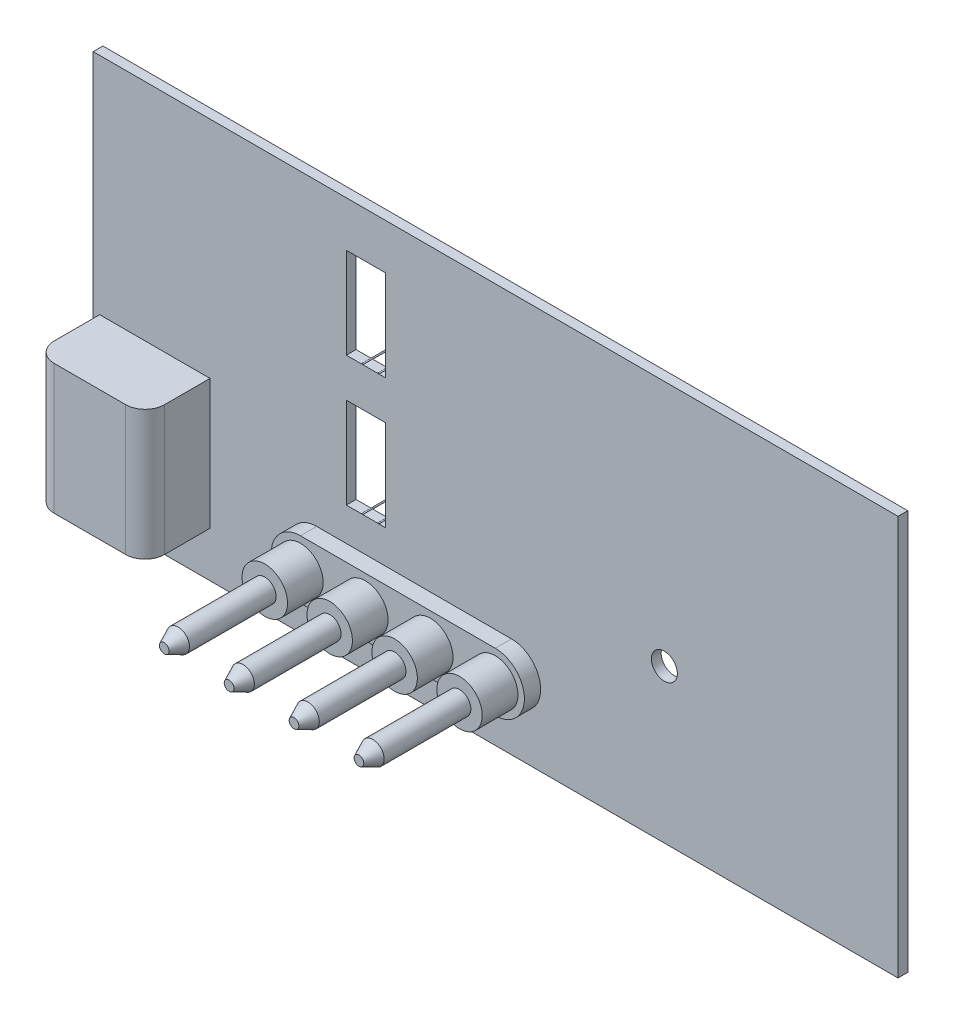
ISO-10303-21;
HEADER;
FILE_DESCRIPTION(('STEP AP214'),'2;1');
FILE_NAME('part.step','',(''),(''),'','','');
FILE_SCHEMA(('AUTOMOTIVE_DESIGN { 1 0 10303 214 1 1 1 1 }'));
ENDSEC;
DATA;
#1=APPLICATION_CONTEXT('core data for automotive mechanical design processes');
#2=APPLICATION_PROTOCOL_DEFINITION('international standard','automotive_design',2000,#1);
#3=PRODUCT_CONTEXT('',#1,'mechanical');
#4=PRODUCT('Part','Part','',(#3));
#5=PRODUCT_RELATED_PRODUCT_CATEGORY('part','',(#4));
#6=PRODUCT_DEFINITION_FORMATION('','',#4);
#7=PRODUCT_DEFINITION_CONTEXT('part definition',#1,'design');
#8=PRODUCT_DEFINITION('design','',#6,#7);
#9=PRODUCT_DEFINITION_SHAPE('','',#8);
#10=(LENGTH_UNIT() NAMED_UNIT(*) SI_UNIT(.MILLI.,.METRE.));
#11=(NAMED_UNIT(*) PLANE_ANGLE_UNIT() SI_UNIT($,.RADIAN.));
#12=(NAMED_UNIT(*) SI_UNIT($,.STERADIAN.) SOLID_ANGLE_UNIT());
#13=UNCERTAINTY_MEASURE_WITH_UNIT(LENGTH_MEASURE(1.E-05),#10,'distance_accuracy_value','');
#14=(GEOMETRIC_REPRESENTATION_CONTEXT(3) GLOBAL_UNCERTAINTY_ASSIGNED_CONTEXT((#13)) GLOBAL_UNIT_ASSIGNED_CONTEXT((#10,
#11,#12)) REPRESENTATION_CONTEXT('',''));
#15=CARTESIAN_POINT('',(0.,0.,0.));
#16=DIRECTION('',(0.,0.,1.));
#17=DIRECTION('',(1.,0.,0.));
#18=AXIS2_PLACEMENT_3D('',#15,#16,#17);
#19=CARTESIAN_POINT('',(-56.81,-18.86,-4.));
#20=DIRECTION('',(0.,0.,-1.));
#21=DIRECTION('',(-1.,0.,0.));
#22=AXIS2_PLACEMENT_3D('',#19,#20,#21);
#23=PLANE('',#22);
#24=CARTESIAN_POINT('',(-56.81,-18.86,-4.));
#25=DIRECTION('',(0.,0.,-1.));
#26=DIRECTION('',(-1.,0.,0.));
#27=AXIS2_PLACEMENT_3D('',#24,#25,#26);
#28=CIRCLE('',#27,1.5);
#29=CARTESIAN_POINT('',(-58.31,-18.86,-4.));
#30=VERTEX_POINT('',#29);
#31=CARTESIAN_POINT('',(-55.31,-18.86,-4.));
#32=VERTEX_POINT('',#31);
#33=EDGE_CURVE('E102',#30,#32,#28,.T.);
#34=ORIENTED_EDGE('',*,*,#33,.F.);
#35=DIRECTION('',(0.,1.,0.));
#36=VECTOR('',#35,1.);
#37=CARTESIAN_POINT('',(-58.31,-17.5371243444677,-4.));
#38=LINE('',#37,#36);
#39=CARTESIAN_POINT('',(-58.31,-17.5371243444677,-4.));
#40=VERTEX_POINT('',#39);
#41=EDGE_CURVE('E64',#30,#40,#38,.T.);
#42=ORIENTED_EDGE('',*,*,#41,.T.);
#43=CARTESIAN_POINT('',(-56.81,-18.86,-4.));
#44=DIRECTION('',(0.,0.,-1.));
#45=DIRECTION('',(-1.,0.,0.));
#46=AXIS2_PLACEMENT_3D('',#43,#44,#45);
#47=CIRCLE('',#46,2.00000000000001);
#48=CARTESIAN_POINT('',(-55.31,-17.5371243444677,-4.));
#49=VERTEX_POINT('',#48);
#50=EDGE_CURVE('E120',#40,#49,#47,.T.);
#51=ORIENTED_EDGE('',*,*,#50,.T.);
#52=DIRECTION('',(0.,-1.,0.));
#53=VECTOR('',#52,1.);
#54=CARTESIAN_POINT('',(-55.31,-17.5371243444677,-4.));
#55=LINE('',#54,#53);
#56=EDGE_CURVE('E103',#49,#32,#55,.T.);
#57=ORIENTED_EDGE('',*,*,#56,.T.);
#58=EDGE_LOOP('',(#34,#42,#51,#57));
#59=FACE_BOUND('',#58,.T.);
#60=ADVANCED_FACE('F42',(#59),#23,.T.);
#61=CARTESIAN_POINT('',(-56.81,-18.86,-4.));
#62=DIRECTION('',(0.,0.,1.));
#63=DIRECTION('',(1.,0.,0.));
#64=AXIS2_PLACEMENT_3D('',#61,#62,#63);
#65=CYLINDRICAL_SURFACE('',#64,2.00000000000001);
#66=CARTESIAN_POINT('',(-56.81,-18.86,-3.));
#67=DIRECTION('',(0.,0.,-1.));
#68=DIRECTION('',(-1.,0.,0.));
#69=AXIS2_PLACEMENT_3D('',#66,#67,#68);
#70=CIRCLE('',#69,2.00000000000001);
#71=CARTESIAN_POINT('',(-58.31,-17.5371243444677,-3.));
#72=VERTEX_POINT('',#71);
#73=CARTESIAN_POINT('',(-55.31,-17.5371243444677,-3.));
#74=VERTEX_POINT('',#73);
#75=EDGE_CURVE('E105',#72,#74,#70,.T.);
#76=ORIENTED_EDGE('',*,*,#75,.T.);
#77=DIRECTION('',(0.,0.,1.));
#78=VECTOR('',#77,1.);
#79=CARTESIAN_POINT('',(-55.31,-17.5371243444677,-4.));
#80=LINE('',#79,#78);
#81=EDGE_CURVE('E108',#49,#74,#80,.T.);
#82=ORIENTED_EDGE('',*,*,#81,.F.);
#83=ORIENTED_EDGE('',*,*,#50,.F.);
#84=DIRECTION('',(0.,0.,1.));
#85=VECTOR('',#84,1.);
#86=CARTESIAN_POINT('',(-58.31,-17.5371243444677,-4.));
#87=LINE('',#86,#85);
#88=EDGE_CURVE('E95',#40,#72,#87,.T.);
#89=ORIENTED_EDGE('',*,*,#88,.T.);
#90=EDGE_LOOP('',(#76,#82,#83,#89));
#91=FACE_BOUND('',#90,.T.);
#92=ADVANCED_FACE('F44',(#91),#65,.T.);
#93=CARTESIAN_POINT('',(-55.31,-17.5371243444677,-4.));
#94=DIRECTION('',(-1.,0.,0.));
#95=DIRECTION('',(0.,0.,1.));
#96=AXIS2_PLACEMENT_3D('',#93,#94,#95);
#97=PLANE('',#96);
#98=DIRECTION('',(0.,-1.,0.));
#99=VECTOR('',#98,1.);
#100=CARTESIAN_POINT('',(-55.31,-17.5371243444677,-3.));
#101=LINE('',#100,#99);
#102=CARTESIAN_POINT('',(-55.31,-20.1828756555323,-3.));
#103=VERTEX_POINT('',#102);
#104=EDGE_CURVE('E114',#74,#103,#101,.T.);
#105=ORIENTED_EDGE('',*,*,#104,.T.);
#106=DIRECTION('',(0.,0.,1.));
#107=VECTOR('',#106,1.);
#108=CARTESIAN_POINT('',(-55.31,-20.1828756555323,-4.));
#109=LINE('',#108,#107);
#110=CARTESIAN_POINT('',(-55.31,-20.1828756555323,-4.));
#111=VERTEX_POINT('',#110);
#112=EDGE_CURVE('E110',#111,#103,#109,.T.);
#113=ORIENTED_EDGE('',*,*,#112,.F.);
#114=EDGE_CURVE('E122',#32,#111,#55,.T.);
#115=ORIENTED_EDGE('',*,*,#114,.F.);
#116=ORIENTED_EDGE('',*,*,#56,.F.);
#117=ORIENTED_EDGE('',*,*,#81,.T.);
#118=EDGE_LOOP('',(#105,#113,#115,#116,#117));
#119=FACE_BOUND('',#118,.T.);
#120=ADVANCED_FACE('F140',(#119),#97,.F.);
#121=CARTESIAN_POINT('',(-56.81,-18.86,-4.));
#122=DIRECTION('',(0.,0.,1.));
#123=DIRECTION('',(1.,0.,0.));
#124=AXIS2_PLACEMENT_3D('',#121,#122,#123);
#125=CYLINDRICAL_SURFACE('',#124,2.);
#126=CARTESIAN_POINT('',(-56.81,-18.86,-3.));
#127=DIRECTION('',(0.,0.,-1.));
#128=DIRECTION('',(-1.,0.,0.));
#129=AXIS2_PLACEMENT_3D('',#126,#127,#128);
#130=CIRCLE('',#129,2.);
#131=CARTESIAN_POINT('',(-58.31,-20.1828756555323,-3.));
#132=VERTEX_POINT('',#131);
#133=EDGE_CURVE('E116',#103,#132,#130,.T.);
#134=ORIENTED_EDGE('',*,*,#133,.T.);
#135=DIRECTION('',(0.,0.,1.));
#136=VECTOR('',#135,1.);
#137=CARTESIAN_POINT('',(-58.31,-20.1828756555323,-4.));
#138=LINE('',#137,#136);
#139=CARTESIAN_POINT('',(-58.31,-20.1828756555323,-4.));
#140=VERTEX_POINT('',#139);
#141=EDGE_CURVE('E126',#140,#132,#138,.T.);
#142=ORIENTED_EDGE('',*,*,#141,.F.);
#143=CARTESIAN_POINT('',(-56.81,-18.86,-4.));
#144=DIRECTION('',(0.,0.,-1.));
#145=DIRECTION('',(-1.,0.,0.));
#146=AXIS2_PLACEMENT_3D('',#143,#144,#145);
#147=CIRCLE('',#146,2.);
#148=EDGE_CURVE('E91',#111,#140,#147,.T.);
#149=ORIENTED_EDGE('',*,*,#148,.F.);
#150=ORIENTED_EDGE('',*,*,#112,.T.);
#151=EDGE_LOOP('',(#134,#142,#149,#150));
#152=FACE_BOUND('',#151,.T.);
#153=ADVANCED_FACE('F132',(#152),#125,.T.);
#154=CARTESIAN_POINT('',(-58.31,-17.5371243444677,-4.));
#155=DIRECTION('',(1.,0.,0.));
#156=DIRECTION('',(0.,1.,0.));
#157=AXIS2_PLACEMENT_3D('',#154,#155,#156);
#158=PLANE('',#157);
#159=DIRECTION('',(0.,1.,0.));
#160=VECTOR('',#159,1.);
#161=CARTESIAN_POINT('',(-58.31,-17.5371243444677,-3.));
#162=LINE('',#161,#160);
#163=EDGE_CURVE('E118',#132,#72,#162,.T.);
#164=ORIENTED_EDGE('',*,*,#163,.T.);
#165=ORIENTED_EDGE('',*,*,#88,.F.);
#166=ORIENTED_EDGE('',*,*,#41,.F.);
#167=EDGE_CURVE('E88',#140,#30,#38,.T.);
#168=ORIENTED_EDGE('',*,*,#167,.F.);
#169=ORIENTED_EDGE('',*,*,#141,.T.);
#170=EDGE_LOOP('',(#164,#165,#166,#168,#169));
#171=FACE_BOUND('',#170,.T.);
#172=ADVANCED_FACE('F97',(#171),#158,.F.);
#173=EDGE_CURVE('E50',#32,#30,#28,.T.);
#174=ORIENTED_EDGE('',*,*,#173,.F.);
#175=ORIENTED_EDGE('',*,*,#114,.T.);
#176=ORIENTED_EDGE('',*,*,#148,.T.);
#177=ORIENTED_EDGE('',*,*,#167,.T.);
#178=EDGE_LOOP('',(#174,#175,#176,#177));
#179=FACE_BOUND('',#178,.T.);
#180=ADVANCED_FACE('F89',(#179),#23,.T.);
#181=CARTESIAN_POINT('',(-56.81,-18.86,-3.));
#182=DIRECTION('',(0.,0.,-1.));
#183=DIRECTION('',(-1.,0.,0.));
#184=AXIS2_PLACEMENT_3D('',#181,#182,#183);
#185=PLANE('',#184);
#186=ORIENTED_EDGE('',*,*,#75,.F.);
#187=ORIENTED_EDGE('',*,*,#163,.F.);
#188=ORIENTED_EDGE('',*,*,#133,.F.);
#189=ORIENTED_EDGE('',*,*,#104,.F.);
#190=EDGE_LOOP('',(#186,#187,#188,#189));
#191=FACE_BOUND('',#190,.T.);
#192=ADVANCED_FACE('F137',(#191),#185,.F.);
#193=CARTESIAN_POINT('',(-56.81,-18.86,-7.));
#194=DIRECTION('',(0.,0.,1.));
#195=DIRECTION('',(1.,0.,0.));
#196=AXIS2_PLACEMENT_3D('',#193,#194,#195);
#197=CYLINDRICAL_SURFACE('',#196,1.5);
#198=CARTESIAN_POINT('',(-56.81,-18.86,-5.5));
#199=DIRECTION('',(0.,0.,1.));
#200=DIRECTION('',(1.,0.,0.));
#201=AXIS2_PLACEMENT_3D('',#198,#199,#200);
#202=CIRCLE('',#201,1.5);
#203=CARTESIAN_POINT('',(-55.31,-18.86,-5.5));
#204=VERTEX_POINT('',#203);
#205=EDGE_CURVE('E12',#204,#204,#202,.T.);
#206=ORIENTED_EDGE('',*,*,#205,.T.);
#207=EDGE_LOOP('',(#206));
#208=FACE_BOUND('',#207,.T.);
#209=ORIENTED_EDGE('',*,*,#33,.T.);
#210=ORIENTED_EDGE('',*,*,#173,.T.);
#211=EDGE_LOOP('',(#209,#210));
#212=FACE_BOUND('',#211,.T.);
#213=ADVANCED_FACE('F107',(#208,#212),#197,.T.);
#214=CARTESIAN_POINT('',(-56.81,-18.86,-5.5));
#215=DIRECTION('',(0.,0.,1.));
#216=DIRECTION('',(1.,0.,0.));
#217=AXIS2_PLACEMENT_3D('',#214,#215,#216);
#218=SPHERICAL_SURFACE('',#217,1.5);
#219=ORIENTED_EDGE('',*,*,#205,.F.);
#220=EDGE_LOOP('',(#219));
#221=FACE_BOUND('',#220,.T.);
#222=ADVANCED_FACE('F194',(#221),#218,.T.);
#223=CLOSED_SHELL('',(#60,#92,#120,#153,#172,#180,#192,#213,#222));
#224=MANIFOLD_SOLID_BREP('B2',#223);
#225=CARTESIAN_POINT('',(-44.0600000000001,17.,1.78284271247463));
#226=DIRECTION('',(0.,0.,-1.));
#227=DIRECTION('',(-1.,0.,0.));
#228=AXIS2_PLACEMENT_3D('',#225,#226,#227);
#229=CYLINDRICAL_SURFACE('',#228,0.100000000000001);
#230=CARTESIAN_POINT('',(-44.0600000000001,17.,-5.));
#231=DIRECTION('',(0.,0.,1.));
#232=DIRECTION('',(1.,0.,0.));
#233=AXIS2_PLACEMENT_3D('',#230,#231,#232);
#234=CIRCLE('',#233,0.100000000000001);
#235=CARTESIAN_POINT('',(-43.9600000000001,17.,-5.));
#236=VERTEX_POINT('',#235);
#237=EDGE_CURVE('E232',#236,#236,#234,.T.);
#238=ORIENTED_EDGE('',*,*,#237,.T.);
#239=EDGE_LOOP('',(#238));
#240=FACE_BOUND('',#239,.T.);
#241=CARTESIAN_POINT('',(-44.0600000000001,17.,1.5));
#242=DIRECTION('',(0.,0.,1.));
#243=DIRECTION('',(1.,0.,0.));
#244=AXIS2_PLACEMENT_3D('',#241,#242,#243);
#245=CIRCLE('',#244,0.100000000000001);
#246=CARTESIAN_POINT('',(-43.9600000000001,17.,1.5));
#247=VERTEX_POINT('',#246);
#248=EDGE_CURVE('E41',#247,#247,#245,.T.);
#249=ORIENTED_EDGE('',*,*,#248,.F.);
#250=EDGE_LOOP('',(#249));
#251=FACE_BOUND('',#250,.T.);
#252=ADVANCED_FACE('F225',(#240,#251),#229,.T.);
#253=CARTESIAN_POINT('',(-44.0600000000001,17.,-5.));
#254=DIRECTION('',(0.,0.,1.));
#255=DIRECTION('',(1.,0.,0.));
#256=AXIS2_PLACEMENT_3D('',#253,#254,#255);
#257=PLANE('',#256);
#258=ORIENTED_EDGE('',*,*,#237,.F.);
#259=EDGE_LOOP('',(#258));
#260=FACE_BOUND('',#259,.T.);
#261=ADVANCED_FACE('F240',(#260),#257,.F.);
#262=CARTESIAN_POINT('',(-88.,38.,1.5));
#263=DIRECTION('',(0.,0.,1.));
#264=DIRECTION('',(1.,0.,0.));
#265=AXIS2_PLACEMENT_3D('',#262,#263,#264);
#266=PLANE('',#265);
#267=ORIENTED_EDGE('',*,*,#248,.T.);
#268=EDGE_LOOP('',(#267));
#269=FACE_BOUND('',#268,.T.);
#270=ADVANCED_FACE('F227',(#269),#266,.T.);
#271=CLOSED_SHELL('',(#252,#261,#270));
#272=MANIFOLD_SOLID_BREP('B6',#271);
#273=CARTESIAN_POINT('',(-46.5600000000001,17.,1.78284271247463));
#274=DIRECTION('',(0.,0.,-1.));
#275=DIRECTION('',(-1.,0.,0.));
#276=AXIS2_PLACEMENT_3D('',#273,#274,#275);
#277=CYLINDRICAL_SURFACE('',#276,0.100000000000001);
#278=CARTESIAN_POINT('',(-46.5600000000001,17.,-5.));
#279=DIRECTION('',(0.,0.,1.));
#280=DIRECTION('',(1.,0.,0.));
#281=AXIS2_PLACEMENT_3D('',#278,#279,#280);
#282=CIRCLE('',#281,0.100000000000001);
#283=CARTESIAN_POINT('',(-46.4600000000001,17.,-5.));
#284=VERTEX_POINT('',#283);
#285=EDGE_CURVE('E281',#284,#284,#282,.T.);
#286=ORIENTED_EDGE('',*,*,#285,.T.);
#287=EDGE_LOOP('',(#286));
#288=FACE_BOUND('',#287,.T.);
#289=CARTESIAN_POINT('',(-46.5600000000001,17.,1.5));
#290=DIRECTION('',(0.,0.,1.));
#291=DIRECTION('',(1.,0.,0.));
#292=AXIS2_PLACEMENT_3D('',#289,#290,#291);
#293=CIRCLE('',#292,0.100000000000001);
#294=CARTESIAN_POINT('',(-46.4600000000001,17.,1.5));
#295=VERTEX_POINT('',#294);
#296=EDGE_CURVE('E224',#295,#295,#293,.T.);
#297=ORIENTED_EDGE('',*,*,#296,.F.);
#298=EDGE_LOOP('',(#297));
#299=FACE_BOUND('',#298,.T.);
#300=ADVANCED_FACE('F274',(#288,#299),#277,.T.);
#301=CARTESIAN_POINT('',(-46.5600000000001,17.,-5.));
#302=DIRECTION('',(0.,0.,1.));
#303=DIRECTION('',(1.,0.,0.));
#304=AXIS2_PLACEMENT_3D('',#301,#302,#303);
#305=PLANE('',#304);
#306=ORIENTED_EDGE('',*,*,#285,.F.);
#307=EDGE_LOOP('',(#306));
#308=FACE_BOUND('',#307,.T.);
#309=ADVANCED_FACE('F289',(#308),#305,.F.);
#310=CARTESIAN_POINT('',(-88.,38.,1.5));
#311=DIRECTION('',(0.,0.,1.));
#312=DIRECTION('',(1.,0.,0.));
#313=AXIS2_PLACEMENT_3D('',#310,#311,#312);
#314=PLANE('',#313);
#315=ORIENTED_EDGE('',*,*,#296,.T.);
#316=EDGE_LOOP('',(#315));
#317=FACE_BOUND('',#316,.T.);
#318=ADVANCED_FACE('F276',(#317),#314,.T.);
#319=CLOSED_SHELL('',(#300,#309,#318));
#320=MANIFOLD_SOLID_BREP('B36',#319);
#321=CARTESIAN_POINT('',(-44.06,-2.99999999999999,1.78284271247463));
#322=DIRECTION('',(0.,0.,-1.));
#323=DIRECTION('',(-1.,0.,0.));
#324=AXIS2_PLACEMENT_3D('',#321,#322,#323);
#325=CYLINDRICAL_SURFACE('',#324,0.100000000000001);
#326=CARTESIAN_POINT('',(-44.06,-2.99999999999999,-5.));
#327=DIRECTION('',(0.,0.,1.));
#328=DIRECTION('',(1.,0.,0.));
#329=AXIS2_PLACEMENT_3D('',#326,#327,#328);
#330=CIRCLE('',#329,0.100000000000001);
#331=CARTESIAN_POINT('',(-43.96,-2.99999999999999,-5.));
#332=VERTEX_POINT('',#331);
#333=EDGE_CURVE('E330',#332,#332,#330,.T.);
#334=ORIENTED_EDGE('',*,*,#333,.T.);
#335=EDGE_LOOP('',(#334));
#336=FACE_BOUND('',#335,.T.);
#337=CARTESIAN_POINT('',(-44.06,-2.99999999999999,1.5));
#338=DIRECTION('',(0.,0.,1.));
#339=DIRECTION('',(1.,0.,0.));
#340=AXIS2_PLACEMENT_3D('',#337,#338,#339);
#341=CIRCLE('',#340,0.100000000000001);
#342=CARTESIAN_POINT('',(-43.96,-2.99999999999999,1.5));
#343=VERTEX_POINT('',#342);
#344=EDGE_CURVE('E273',#343,#343,#341,.T.);
#345=ORIENTED_EDGE('',*,*,#344,.F.);
#346=EDGE_LOOP('',(#345));
#347=FACE_BOUND('',#346,.T.);
#348=ADVANCED_FACE('F323',(#336,#347),#325,.T.);
#349=CARTESIAN_POINT('',(-44.06,-2.99999999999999,-5.));
#350=DIRECTION('',(0.,0.,1.));
#351=DIRECTION('',(1.,0.,0.));
#352=AXIS2_PLACEMENT_3D('',#349,#350,#351);
#353=PLANE('',#352);
#354=ORIENTED_EDGE('',*,*,#333,.F.);
#355=EDGE_LOOP('',(#354));
#356=FACE_BOUND('',#355,.T.);
#357=ADVANCED_FACE('F338',(#356),#353,.F.);
#358=CARTESIAN_POINT('',(-88.,38.,1.5));
#359=DIRECTION('',(0.,0.,1.));
#360=DIRECTION('',(1.,0.,0.));
#361=AXIS2_PLACEMENT_3D('',#358,#359,#360);
#362=PLANE('',#361);
#363=ORIENTED_EDGE('',*,*,#344,.T.);
#364=EDGE_LOOP('',(#363));
#365=FACE_BOUND('',#364,.T.);
#366=ADVANCED_FACE('F325',(#365),#362,.T.);
#367=CLOSED_SHELL('',(#348,#357,#366));
#368=MANIFOLD_SOLID_BREP('B219',#367);
#369=CARTESIAN_POINT('',(-46.56,-2.99999999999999,1.78284271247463));
#370=DIRECTION('',(0.,0.,-1.));
#371=DIRECTION('',(-1.,0.,0.));
#372=AXIS2_PLACEMENT_3D('',#369,#370,#371);
#373=CYLINDRICAL_SURFACE('',#372,0.100000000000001);
#374=CARTESIAN_POINT('',(-46.56,-2.99999999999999,-5.));
#375=DIRECTION('',(0.,0.,1.));
#376=DIRECTION('',(1.,0.,0.));
#377=AXIS2_PLACEMENT_3D('',#374,#375,#376);
#378=CIRCLE('',#377,0.100000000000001);
#379=CARTESIAN_POINT('',(-46.46,-2.99999999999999,-5.));
#380=VERTEX_POINT('',#379);
#381=EDGE_CURVE('E379',#380,#380,#378,.T.);
#382=ORIENTED_EDGE('',*,*,#381,.T.);
#383=EDGE_LOOP('',(#382));
#384=FACE_BOUND('',#383,.T.);
#385=CARTESIAN_POINT('',(-46.56,-2.99999999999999,1.5));
#386=DIRECTION('',(0.,0.,1.));
#387=DIRECTION('',(1.,0.,0.));
#388=AXIS2_PLACEMENT_3D('',#385,#386,#387);
#389=CIRCLE('',#388,0.100000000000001);
#390=CARTESIAN_POINT('',(-46.46,-2.99999999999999,1.5));
#391=VERTEX_POINT('',#390);
#392=EDGE_CURVE('E322',#391,#391,#389,.T.);
#393=ORIENTED_EDGE('',*,*,#392,.F.);
#394=EDGE_LOOP('',(#393));
#395=FACE_BOUND('',#394,.T.);
#396=ADVANCED_FACE('F372',(#384,#395),#373,.T.);
#397=CARTESIAN_POINT('',(-46.56,-2.99999999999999,-5.));
#398=DIRECTION('',(0.,0.,1.));
#399=DIRECTION('',(1.,0.,0.));
#400=AXIS2_PLACEMENT_3D('',#397,#398,#399);
#401=PLANE('',#400);
#402=ORIENTED_EDGE('',*,*,#381,.F.);
#403=EDGE_LOOP('',(#402));
#404=FACE_BOUND('',#403,.T.);
#405=ADVANCED_FACE('F387',(#404),#401,.F.);
#406=CARTESIAN_POINT('',(-88.,38.,1.5));
#407=DIRECTION('',(0.,0.,1.));
#408=DIRECTION('',(1.,0.,0.));
#409=AXIS2_PLACEMENT_3D('',#406,#407,#408);
#410=PLANE('',#409);
#411=ORIENTED_EDGE('',*,*,#392,.T.);
#412=EDGE_LOOP('',(#411));
#413=FACE_BOUND('',#412,.T.);
#414=ADVANCED_FACE('F374',(#413),#410,.T.);
#415=CLOSED_SHELL('',(#396,#405,#414));
#416=MANIFOLD_SOLID_BREP('B268',#415);
#417=CARTESIAN_POINT('',(-45.31,17.,-5.));
#418=DIRECTION('',(0.,0.,-1.));
#419=DIRECTION('',(-1.,0.,0.));
#420=AXIS2_PLACEMENT_3D('',#417,#418,#419);
#421=CYLINDRICAL_SURFACE('',#420,3.);
#422=CARTESIAN_POINT('',(-45.31,17.,-5.));
#423=DIRECTION('',(0.,0.,1.));
#424=DIRECTION('',(1.,0.,0.));
#425=AXIS2_PLACEMENT_3D('',#422,#423,#424);
#426=CIRCLE('',#425,3.);
#427=CARTESIAN_POINT('',(-42.31,17.,-5.));
#428=VERTEX_POINT('',#427);
#429=EDGE_CURVE('E371',#428,#428,#426,.T.);
#430=ORIENTED_EDGE('',*,*,#429,.F.);
#431=EDGE_LOOP('',(#430));
#432=FACE_BOUND('',#431,.T.);
#433=CARTESIAN_POINT('',(-45.31,17.,-6.));
#434=DIRECTION('',(0.,0.,1.));
#435=DIRECTION('',(1.,0.,0.));
#436=AXIS2_PLACEMENT_3D('',#433,#434,#435);
#437=CIRCLE('',#436,3.);
#438=CARTESIAN_POINT('',(-42.31,17.,-6.));
#439=VERTEX_POINT('',#438);
#440=EDGE_CURVE('E427',#439,#439,#437,.T.);
#441=ORIENTED_EDGE('',*,*,#440,.T.);
#442=EDGE_LOOP('',(#441));
#443=FACE_BOUND('',#442,.T.);
#444=ADVANCED_FACE('F421',(#432,#443),#421,.T.);
#445=CARTESIAN_POINT('',(-45.31,17.,-5.));
#446=DIRECTION('',(0.,0.,1.));
#447=DIRECTION('',(1.,0.,0.));
#448=AXIS2_PLACEMENT_3D('',#445,#446,#447);
#449=PLANE('',#448);
#450=ORIENTED_EDGE('',*,*,#429,.T.);
#451=EDGE_LOOP('',(#450));
#452=FACE_BOUND('',#451,.T.);
#453=ADVANCED_FACE('F436',(#452),#449,.T.);
#454=CARTESIAN_POINT('',(-45.31,17.,-6.));
#455=DIRECTION('',(0.,0.,1.));
#456=DIRECTION('',(1.,0.,0.));
#457=AXIS2_PLACEMENT_3D('',#454,#455,#456);
#458=PLANE('',#457);
#459=ORIENTED_EDGE('',*,*,#440,.F.);
#460=EDGE_LOOP('',(#459));
#461=FACE_BOUND('',#460,.T.);
#462=ADVANCED_FACE('F434',(#461),#458,.F.);
#463=CLOSED_SHELL('',(#444,#453,#462));
#464=MANIFOLD_SOLID_BREP('B317',#463);
#465=CARTESIAN_POINT('',(-45.31,17.,-13.));
#466=DIRECTION('',(0.,0.,1.));
#467=DIRECTION('',(1.,0.,0.));
#468=AXIS2_PLACEMENT_3D('',#465,#466,#467);
#469=CYLINDRICAL_SURFACE('',#468,2.5);
#470=CARTESIAN_POINT('',(-45.31,17.,-11.));
#471=DIRECTION('',(0.,0.,-1.));
#472=DIRECTION('',(-1.,0.,0.));
#473=AXIS2_PLACEMENT_3D('',#470,#471,#472);
#474=CIRCLE('',#473,2.5);
#475=CARTESIAN_POINT('',(-47.81,17.,-11.));
#476=VERTEX_POINT('',#475);
#477=EDGE_CURVE('E420',#476,#476,#474,.F.);
#478=ORIENTED_EDGE('',*,*,#477,.T.);
#479=EDGE_LOOP('',(#478));
#480=FACE_BOUND('',#479,.T.);
#481=CARTESIAN_POINT('',(-45.31,17.,-6.));
#482=DIRECTION('',(0.,0.,-1.));
#483=DIRECTION('',(-1.,0.,0.));
#484=AXIS2_PLACEMENT_3D('',#481,#482,#483);
#485=CIRCLE('',#484,2.5);
#486=CARTESIAN_POINT('',(-47.81,17.,-6.));
#487=VERTEX_POINT('',#486);
#488=EDGE_CURVE('E480',#487,#487,#485,.T.);
#489=ORIENTED_EDGE('',*,*,#488,.T.);
#490=EDGE_LOOP('',(#489));
#491=FACE_BOUND('',#490,.T.);
#492=ADVANCED_FACE('F470',(#480,#491),#469,.T.);
#493=CARTESIAN_POINT('',(-45.31,17.,-13.));
#494=DIRECTION('',(0.,0.,-1.));
#495=DIRECTION('',(-1.,0.,0.));
#496=AXIS2_PLACEMENT_3D('',#493,#494,#495);
#497=PLANE('',#496);
#498=CARTESIAN_POINT('',(-45.31,17.,-13.));
#499=DIRECTION('',(0.,0.,-1.));
#500=DIRECTION('',(-1.,0.,0.));
#501=AXIS2_PLACEMENT_3D('',#498,#499,#500);
#502=CIRCLE('',#501,0.500000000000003);
#503=CARTESIAN_POINT('',(-45.81,17.,-13.));
#504=VERTEX_POINT('',#503);
#505=EDGE_CURVE('E476',#504,#504,#502,.T.);
#506=ORIENTED_EDGE('',*,*,#505,.T.);
#507=EDGE_LOOP('',(#506));
#508=FACE_BOUND('',#507,.T.);
#509=ADVANCED_FACE('F491',(#508),#497,.T.);
#510=CARTESIAN_POINT('',(-45.31,17.,-6.));
#511=DIRECTION('',(0.,0.,-1.));
#512=DIRECTION('',(-1.,0.,0.));
#513=AXIS2_PLACEMENT_3D('',#510,#511,#512);
#514=PLANE('',#513);
#515=ORIENTED_EDGE('',*,*,#488,.F.);
#516=EDGE_LOOP('',(#515));
#517=FACE_BOUND('',#516,.T.);
#518=ADVANCED_FACE('F488',(#517),#514,.F.);
#519=CARTESIAN_POINT('',(-45.31,17.,-11.));
#520=DIRECTION('',(0.,0.,-1.));
#521=DIRECTION('',(-1.,0.,0.));
#522=AXIS2_PLACEMENT_3D('',#519,#520,#521);
#523=DEGENERATE_TOROIDAL_SURFACE('',#522,0.500000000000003,2.,.T.);
#524=ORIENTED_EDGE('',*,*,#477,.F.);
#525=EDGE_LOOP('',(#524));
#526=FACE_BOUND('',#525,.T.);
#527=ORIENTED_EDGE('',*,*,#505,.F.);
#528=EDGE_LOOP('',(#527));
#529=FACE_BOUND('',#528,.T.);
#530=ADVANCED_FACE('F490',(#526,#529),#523,.T.);
#531=CLOSED_SHELL('',(#492,#509,#518,#530));
#532=MANIFOLD_SOLID_BREP('B366',#531);
#533=CARTESIAN_POINT('',(-45.31,-3.,-13.));
#534=DIRECTION('',(0.,0.,1.));
#535=DIRECTION('',(1.,0.,0.));
#536=AXIS2_PLACEMENT_3D('',#533,#534,#535);
#537=CYLINDRICAL_SURFACE('',#536,2.5);
#538=CARTESIAN_POINT('',(-45.31,-3.,-11.));
#539=DIRECTION('',(0.,0.,-1.));
#540=DIRECTION('',(-1.,0.,0.));
#541=AXIS2_PLACEMENT_3D('',#538,#539,#540);
#542=CIRCLE('',#541,2.5);
#543=CARTESIAN_POINT('',(-47.81,-3.,-11.));
#544=VERTEX_POINT('',#543);
#545=EDGE_CURVE('E469',#544,#544,#542,.F.);
#546=ORIENTED_EDGE('',*,*,#545,.T.);
#547=EDGE_LOOP('',(#546));
#548=FACE_BOUND('',#547,.T.);
#549=CARTESIAN_POINT('',(-45.31,-3.,-6.));
#550=DIRECTION('',(0.,0.,1.));
#551=DIRECTION('',(1.,0.,0.));
#552=AXIS2_PLACEMENT_3D('',#549,#550,#551);
#553=CIRCLE('',#552,2.5);
#554=CARTESIAN_POINT('',(-42.81,-3.,-6.));
#555=VERTEX_POINT('',#554);
#556=EDGE_CURVE('E545',#555,#555,#553,.T.);
#557=ORIENTED_EDGE('',*,*,#556,.F.);
#558=EDGE_LOOP('',(#557));
#559=FACE_BOUND('',#558,.T.);
#560=ADVANCED_FACE('F535',(#548,#559),#537,.T.);
#561=CARTESIAN_POINT('',(-45.31,-3.,-13.));
#562=DIRECTION('',(0.,0.,-1.));
#563=DIRECTION('',(-1.,0.,0.));
#564=AXIS2_PLACEMENT_3D('',#561,#562,#563);
#565=PLANE('',#564);
#566=CARTESIAN_POINT('',(-45.31,-3.,-13.));
#567=DIRECTION('',(0.,0.,-1.));
#568=DIRECTION('',(-1.,0.,0.));
#569=AXIS2_PLACEMENT_3D('',#566,#567,#568);
#570=CIRCLE('',#569,0.500000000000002);
#571=CARTESIAN_POINT('',(-45.81,-3.,-13.));
#572=VERTEX_POINT('',#571);
#573=EDGE_CURVE('E541',#572,#572,#570,.T.);
#574=ORIENTED_EDGE('',*,*,#573,.T.);
#575=EDGE_LOOP('',(#574));
#576=FACE_BOUND('',#575,.T.);
#577=ADVANCED_FACE('F568',(#576),#565,.T.);
#578=CARTESIAN_POINT('',(-45.31,-3.,-11.));
#579=DIRECTION('',(0.,0.,-1.));
#580=DIRECTION('',(-1.,0.,0.));
#581=AXIS2_PLACEMENT_3D('',#578,#579,#580);
#582=DEGENERATE_TOROIDAL_SURFACE('',#581,0.500000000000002,2.,.T.);
#583=ORIENTED_EDGE('',*,*,#545,.F.);
#584=EDGE_LOOP('',(#583));
#585=FACE_BOUND('',#584,.T.);
#586=ORIENTED_EDGE('',*,*,#573,.F.);
#587=EDGE_LOOP('',(#586));
#588=FACE_BOUND('',#587,.T.);
#589=ADVANCED_FACE('F563',(#585,#588),#582,.T.);
#590=CARTESIAN_POINT('',(-45.31,-3.,-6.));
#591=DIRECTION('',(0.,0.,1.));
#592=DIRECTION('',(1.,0.,0.));
#593=AXIS2_PLACEMENT_3D('',#590,#591,#592);
#594=PLANE('',#593);
#595=CARTESIAN_POINT('',(-45.31,-3.,-6.));
#596=DIRECTION('',(0.,0.,1.));
#597=DIRECTION('',(1.,0.,0.));
#598=AXIS2_PLACEMENT_3D('',#595,#596,#597);
#599=CIRCLE('',#598,3.);
#600=CARTESIAN_POINT('',(-42.31,-3.,-6.));
#601=VERTEX_POINT('',#600);
#602=EDGE_CURVE('E554',#601,#601,#599,.T.);
#603=ORIENTED_EDGE('',*,*,#602,.F.);
#604=EDGE_LOOP('',(#603));
#605=FACE_BOUND('',#604,.T.);
#606=ORIENTED_EDGE('',*,*,#556,.T.);
#607=EDGE_LOOP('',(#606));
#608=FACE_BOUND('',#607,.T.);
#609=ADVANCED_FACE('F560',(#605,#608),#594,.F.);
#610=CARTESIAN_POINT('',(-45.31,-3.,-5.));
#611=DIRECTION('',(0.,0.,-1.));
#612=DIRECTION('',(-1.,0.,0.));
#613=AXIS2_PLACEMENT_3D('',#610,#611,#612);
#614=CYLINDRICAL_SURFACE('',#613,3.);
#615=CARTESIAN_POINT('',(-45.31,-3.,-5.));
#616=DIRECTION('',(0.,0.,1.));
#617=DIRECTION('',(1.,0.,0.));
#618=AXIS2_PLACEMENT_3D('',#615,#616,#617);
#619=CIRCLE('',#618,3.);
#620=CARTESIAN_POINT('',(-42.31,-3.,-5.));
#621=VERTEX_POINT('',#620);
#622=EDGE_CURVE('E549',#621,#621,#619,.T.);
#623=ORIENTED_EDGE('',*,*,#622,.F.);
#624=EDGE_LOOP('',(#623));
#625=FACE_BOUND('',#624,.T.);
#626=ORIENTED_EDGE('',*,*,#602,.T.);
#627=EDGE_LOOP('',(#626));
#628=FACE_BOUND('',#627,.T.);
#629=ADVANCED_FACE('F558',(#625,#628),#614,.T.);
#630=CARTESIAN_POINT('',(-45.31,-3.,-5.));
#631=DIRECTION('',(0.,0.,1.));
#632=DIRECTION('',(1.,0.,0.));
#633=AXIS2_PLACEMENT_3D('',#630,#631,#632);
#634=PLANE('',#633);
#635=ORIENTED_EDGE('',*,*,#622,.T.);
#636=EDGE_LOOP('',(#635));
#637=FACE_BOUND('',#636,.T.);
#638=ADVANCED_FACE('F580',(#637),#634,.T.);
#639=CLOSED_SHELL('',(#560,#577,#589,#609,#629,#638));
#640=MANIFOLD_SOLID_BREP('B415',#639);
#641=CARTESIAN_POINT('',(-88.,-23.6,1.5));
#642=DIRECTION('',(0.,1.,0.));
#643=DIRECTION('',(0.,0.,1.));
#644=AXIS2_PLACEMENT_3D('',#641,#642,#643);
#645=PLANE('',#644);
#646=DIRECTION('',(1.,0.,0.));
#647=VECTOR('',#646,1.);
#648=CARTESIAN_POINT('',(-88.,-23.6,0.));
#649=LINE('',#648,#647);
#650=CARTESIAN_POINT('',(-45.2695139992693,-23.6,0.));
#651=VERTEX_POINT('',#650);
#652=CARTESIAN_POINT('',(-44.3602883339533,-23.6,0.));
#653=VERTEX_POINT('',#652);
#654=EDGE_CURVE('E818',#651,#653,#649,.T.);
#655=ORIENTED_EDGE('',*,*,#654,.T.);
#656=DIRECTION('',(0.,0.,1.));
#657=VECTOR('',#656,1.);
#658=CARTESIAN_POINT('',(-44.3602883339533,-23.6,-500000.));
#659=LINE('',#658,#657);
#660=CARTESIAN_POINT('',(-44.3602883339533,-23.6,1.5));
#661=VERTEX_POINT('',#660);
#662=EDGE_CURVE('E805',#653,#661,#659,.T.);
#663=ORIENTED_EDGE('',*,*,#662,.T.);
#664=DIRECTION('',(1.,0.,0.));
#665=VECTOR('',#664,1.);
#666=CARTESIAN_POINT('',(-88.,-23.6,1.5));
#667=LINE('',#666,#665);
#668=CARTESIAN_POINT('',(-45.2695139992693,-23.6,1.5));
#669=VERTEX_POINT('',#668);
#670=EDGE_CURVE('E816',#669,#661,#667,.T.);
#671=ORIENTED_EDGE('',*,*,#670,.F.);
#672=DIRECTION('',(0.,0.,1.));
#673=VECTOR('',#672,1.);
#674=CARTESIAN_POINT('',(-45.2695139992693,-23.6,-500000.));
#675=LINE('',#674,#673);
#676=EDGE_CURVE('E1338',#669,#651,#675,.F.);
#677=ORIENTED_EDGE('',*,*,#676,.T.);
#678=EDGE_LOOP('',(#655,#663,#671,#677));
#679=FACE_BOUND('',#678,.T.);
#680=ADVANCED_FACE('F621',(#679),#645,.F.);
#681=CARTESIAN_POINT('',(-46.3592795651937,-23.6,0.));
#682=VERTEX_POINT('',#681);
#683=CARTESIAN_POINT('',(-45.4695139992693,-23.6,0.));
#684=VERTEX_POINT('',#683);
#685=EDGE_CURVE('E948',#682,#684,#649,.T.);
#686=ORIENTED_EDGE('',*,*,#685,.T.);
#687=DIRECTION('',(0.,0.,1.));
#688=VECTOR('',#687,1.);
#689=CARTESIAN_POINT('',(-45.4695139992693,-23.6,-500000.));
#690=LINE('',#689,#688);
#691=CARTESIAN_POINT('',(-45.4695139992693,-23.6,1.5));
#692=VERTEX_POINT('',#691);
#693=EDGE_CURVE('E1341',#684,#692,#690,.T.);
#694=ORIENTED_EDGE('',*,*,#693,.T.);
#695=CARTESIAN_POINT('',(-46.3592795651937,-23.6,1.5));
#696=VERTEX_POINT('',#695);
#697=EDGE_CURVE('E824',#696,#692,#667,.T.);
#698=ORIENTED_EDGE('',*,*,#697,.F.);
#699=DIRECTION('',(0.,0.,1.));
#700=VECTOR('',#699,1.);
#701=CARTESIAN_POINT('',(-46.3592795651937,-23.6,-500000.));
#702=LINE('',#701,#700);
#703=EDGE_CURVE('E629',#696,#682,#702,.F.);
#704=ORIENTED_EDGE('',*,*,#703,.T.);
#705=EDGE_LOOP('',(#686,#694,#698,#704));
#706=FACE_BOUND('',#705,.T.);
#707=ADVANCED_FACE('F946',(#706),#645,.F.);
#708=CARTESIAN_POINT('',(-88.,-23.6,0.));
#709=VERTEX_POINT('',#708);
#710=CARTESIAN_POINT('',(-46.5592795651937,-23.6,0.));
#711=VERTEX_POINT('',#710);
#712=EDGE_CURVE('E959',#709,#711,#649,.T.);
#713=ORIENTED_EDGE('',*,*,#712,.T.);
#714=DIRECTION('',(0.,0.,1.));
#715=VECTOR('',#714,1.);
#716=CARTESIAN_POINT('',(-46.5592795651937,-23.6,-500000.));
#717=LINE('',#716,#715);
#718=CARTESIAN_POINT('',(-46.5592795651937,-23.6,1.5));
#719=VERTEX_POINT('',#718);
#720=EDGE_CURVE('E533',#711,#719,#717,.T.);
#721=ORIENTED_EDGE('',*,*,#720,.T.);
#722=CARTESIAN_POINT('',(-88.,-23.6,1.5));
#723=VERTEX_POINT('',#722);
#724=EDGE_CURVE('E827',#723,#719,#667,.T.);
#725=ORIENTED_EDGE('',*,*,#724,.F.);
#726=DIRECTION('',(0.,0.,-1.));
#727=VECTOR('',#726,1.);
#728=CARTESIAN_POINT('',(-88.,-23.6,1.5));
#729=LINE('',#728,#727);
#730=EDGE_CURVE('E846',#723,#709,#729,.T.);
#731=ORIENTED_EDGE('',*,*,#730,.T.);
#732=EDGE_LOOP('',(#713,#721,#725,#731));
#733=FACE_BOUND('',#732,.T.);
#734=ADVANCED_FACE('F979',(#733),#645,.F.);
#735=CARTESIAN_POINT('',(-88.,38.,1.5));
#736=DIRECTION('',(0.,0.,1.));
#737=DIRECTION('',(1.,0.,0.));
#738=AXIS2_PLACEMENT_3D('',#735,#736,#737);
#739=PLANE('',#738);
#740=ORIENTED_EDGE('',*,*,#670,.T.);
#741=CARTESIAN_POINT('',(-44.2602883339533,-23.6,1.5));
#742=DIRECTION('',(0.,0.,1.));
#743=DIRECTION('',(1.,0.,0.));
#744=AXIS2_PLACEMENT_3D('',#741,#742,#743);
#745=CIRCLE('',#744,0.100000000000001);
#746=CARTESIAN_POINT('',(-44.1602883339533,-23.6,1.5));
#747=VERTEX_POINT('',#746);
#748=EDGE_CURVE('E636',#661,#747,#745,.T.);
#749=ORIENTED_EDGE('',*,*,#748,.T.);
#750=CARTESIAN_POINT('',(36.,-23.6,1.5));
#751=VERTEX_POINT('',#750);
#752=EDGE_CURVE('E825',#747,#751,#667,.T.);
#753=ORIENTED_EDGE('',*,*,#752,.T.);
#754=DIRECTION('',(0.,1.,0.));
#755=VECTOR('',#754,1.);
#756=CARTESIAN_POINT('',(36.,38.,1.5));
#757=LINE('',#756,#755);
#758=CARTESIAN_POINT('',(36.,38.,1.5));
#759=VERTEX_POINT('',#758);
#760=EDGE_CURVE('E832',#751,#759,#757,.T.);
#761=ORIENTED_EDGE('',*,*,#760,.T.);
#762=DIRECTION('',(-1.,0.,0.));
#763=VECTOR('',#762,1.);
#764=CARTESIAN_POINT('',(-88.,38.,1.5));
#765=LINE('',#764,#763);
#766=CARTESIAN_POINT('',(-88.,38.,1.5));
#767=VERTEX_POINT('',#766);
#768=EDGE_CURVE('E835',#759,#767,#765,.T.);
#769=ORIENTED_EDGE('',*,*,#768,.T.);
#770=DIRECTION('',(0.,-1.,0.));
#771=VECTOR('',#770,1.);
#772=CARTESIAN_POINT('',(-88.,38.,1.5));
#773=LINE('',#772,#771);
#774=EDGE_CURVE('E828',#767,#723,#773,.T.);
#775=ORIENTED_EDGE('',*,*,#774,.T.);
#776=ORIENTED_EDGE('',*,*,#724,.T.);
#777=CARTESIAN_POINT('',(-46.4592795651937,-23.6,1.5));
#778=DIRECTION('',(0.,0.,1.));
#779=DIRECTION('',(1.,0.,0.));
#780=AXIS2_PLACEMENT_3D('',#777,#778,#779);
#781=CIRCLE('',#780,0.100000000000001);
#782=EDGE_CURVE('E981',#719,#696,#781,.T.);
#783=ORIENTED_EDGE('',*,*,#782,.T.);
#784=ORIENTED_EDGE('',*,*,#697,.T.);
#785=CARTESIAN_POINT('',(-45.3695139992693,-23.6,1.5));
#786=DIRECTION('',(0.,0.,1.));
#787=DIRECTION('',(1.,0.,0.));
#788=AXIS2_PLACEMENT_3D('',#785,#786,#787);
#789=CIRCLE('',#788,0.100000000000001);
#790=EDGE_CURVE('E642',#692,#669,#789,.T.);
#791=ORIENTED_EDGE('',*,*,#790,.T.);
#792=EDGE_LOOP('',(#740,#749,#753,#761,#769,#775,#776,#783,#784,#791));
#793=FACE_BOUND('',#792,.T.);
#794=DIRECTION('',(0.,-1.,0.));
#795=VECTOR('',#794,1.);
#796=CARTESIAN_POINT('',(-49.,17.,1.5));
#797=LINE('',#796,#795);
#798=CARTESIAN_POINT('',(-49.,31.,1.5));
#799=VERTEX_POINT('',#798);
#800=CARTESIAN_POINT('',(-49.,17.,1.5));
#801=VERTEX_POINT('',#800);
#802=EDGE_CURVE('E984',#799,#801,#797,.T.);
#803=ORIENTED_EDGE('',*,*,#802,.F.);
#804=DIRECTION('',(-1.,0.,0.));
#805=VECTOR('',#804,1.);
#806=CARTESIAN_POINT('',(-49.,31.,1.5));
#807=LINE('',#806,#805);
#808=CARTESIAN_POINT('',(-43.,31.,1.5));
#809=VERTEX_POINT('',#808);
#810=EDGE_CURVE('E998',#809,#799,#807,.T.);
#811=ORIENTED_EDGE('',*,*,#810,.F.);
#812=DIRECTION('',(0.,1.,0.));
#813=VECTOR('',#812,1.);
#814=CARTESIAN_POINT('',(-43.,17.,1.5));
#815=LINE('',#814,#813);
#816=CARTESIAN_POINT('',(-43.,17.,1.5));
#817=VERTEX_POINT('',#816);
#818=EDGE_CURVE('E995',#817,#809,#815,.T.);
#819=ORIENTED_EDGE('',*,*,#818,.F.);
#820=DIRECTION('',(1.,0.,0.));
#821=VECTOR('',#820,1.);
#822=CARTESIAN_POINT('',(-49.,17.,1.5));
#823=LINE('',#822,#821);
#824=EDGE_CURVE('E992',#801,#817,#823,.T.);
#825=ORIENTED_EDGE('',*,*,#824,.F.);
#826=EDGE_LOOP('',(#803,#811,#819,#825));
#827=FACE_BOUND('',#826,.T.);
#828=DIRECTION('',(0.,-1.,0.));
#829=VECTOR('',#828,1.);
#830=CARTESIAN_POINT('',(-49.,-2.99999999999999,1.5));
#831=LINE('',#830,#829);
#832=CARTESIAN_POINT('',(-49.,11.,1.5));
#833=VERTEX_POINT('',#832);
#834=CARTESIAN_POINT('',(-49.,-2.99999999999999,1.5));
#835=VERTEX_POINT('',#834);
#836=EDGE_CURVE('E1004',#833,#835,#831,.T.);
#837=ORIENTED_EDGE('',*,*,#836,.F.);
#838=DIRECTION('',(-1.,0.,0.));
#839=VECTOR('',#838,1.);
#840=CARTESIAN_POINT('',(-49.,11.,1.5));
#841=LINE('',#840,#839);
#842=CARTESIAN_POINT('',(-43.,11.,1.5));
#843=VERTEX_POINT('',#842);
#844=EDGE_CURVE('E1018',#843,#833,#841,.T.);
#845=ORIENTED_EDGE('',*,*,#844,.F.);
#846=DIRECTION('',(0.,1.,0.));
#847=VECTOR('',#846,1.);
#848=CARTESIAN_POINT('',(-43.,-2.99999999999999,1.5));
#849=LINE('',#848,#847);
#850=CARTESIAN_POINT('',(-43.,-2.99999999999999,1.5));
#851=VERTEX_POINT('',#850);
#852=EDGE_CURVE('E1015',#851,#843,#849,.T.);
#853=ORIENTED_EDGE('',*,*,#852,.F.);
#854=DIRECTION('',(1.,0.,0.));
#855=VECTOR('',#854,1.);
#856=CARTESIAN_POINT('',(-49.,-2.99999999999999,1.5));
#857=LINE('',#856,#855);
#858=EDGE_CURVE('E1012',#835,#851,#857,.T.);
#859=ORIENTED_EDGE('',*,*,#858,.F.);
#860=EDGE_LOOP('',(#837,#845,#853,#859));
#861=FACE_BOUND('',#860,.T.);
#862=DIRECTION('',(1.,0.,0.));
#863=VECTOR('',#862,1.);
#864=CARTESIAN_POINT('',(-87.,-16.6,1.5));
#865=LINE('',#864,#863);
#866=CARTESIAN_POINT('',(-87.,-16.6,1.5));
#867=VERTEX_POINT('',#866);
#868=CARTESIAN_POINT('',(-70.,-16.6,1.5));
#869=VERTEX_POINT('',#868);
#870=EDGE_CURVE('E1072',#867,#869,#865,.T.);
#871=ORIENTED_EDGE('',*,*,#870,.F.);
#872=DIRECTION('',(0.,-1.,0.));
#873=VECTOR('',#872,1.);
#874=CARTESIAN_POINT('',(-87.,3.4,1.5));
#875=LINE('',#874,#873);
#876=CARTESIAN_POINT('',(-87.,3.4,1.5));
#877=VERTEX_POINT('',#876);
#878=EDGE_CURVE('E1069',#877,#867,#875,.T.);
#879=ORIENTED_EDGE('',*,*,#878,.F.);
#880=DIRECTION('',(-1.,0.,0.));
#881=VECTOR('',#880,1.);
#882=CARTESIAN_POINT('',(-87.,3.4,1.5));
#883=LINE('',#882,#881);
#884=CARTESIAN_POINT('',(-70.,3.39999999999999,1.5));
#885=VERTEX_POINT('',#884);
#886=EDGE_CURVE('E1078',#885,#877,#883,.T.);
#887=ORIENTED_EDGE('',*,*,#886,.F.);
#888=DIRECTION('',(0.,1.,0.));
#889=VECTOR('',#888,1.);
#890=CARTESIAN_POINT('',(-70.,-16.6,1.5));
#891=LINE('',#890,#889);
#892=EDGE_CURVE('E1075',#869,#885,#891,.T.);
#893=ORIENTED_EDGE('',*,*,#892,.F.);
#894=EDGE_LOOP('',(#871,#879,#887,#893));
#895=FACE_BOUND('',#894,.T.);
#896=CARTESIAN_POINT('',(0.,0.,1.5));
#897=DIRECTION('',(0.,0.,1.));
#898=DIRECTION('',(1.,0.,0.));
#899=AXIS2_PLACEMENT_3D('',#896,#897,#898);
#900=CIRCLE('',#899,2.);
#901=CARTESIAN_POINT('',(2.,0.,1.5));
#902=VERTEX_POINT('',#901);
#903=EDGE_CURVE('E1097',#902,#902,#900,.T.);
#904=ORIENTED_EDGE('',*,*,#903,.F.);
#905=EDGE_LOOP('',(#904));
#906=FACE_BOUND('',#905,.T.);
#907=DIRECTION('',(1.,0.,0.));
#908=VECTOR('',#907,1.);
#909=CARTESIAN_POINT('',(-53.56,-17.13,1.5));
#910=LINE('',#909,#908);
#911=CARTESIAN_POINT('',(-53.56,-17.13,1.5));
#912=VERTEX_POINT('',#911);
#913=CARTESIAN_POINT('',(-23.56,-17.13,1.5));
#914=VERTEX_POINT('',#913);
#915=EDGE_CURVE('E1043',#912,#914,#910,.T.);
#916=ORIENTED_EDGE('',*,*,#915,.F.);
#917=CARTESIAN_POINT('',(-53.56,-12.63,1.5));
#918=DIRECTION('',(0.,0.,1.));
#919=DIRECTION('',(1.,0.,0.));
#920=AXIS2_PLACEMENT_3D('',#917,#918,#919);
#921=CIRCLE('',#920,4.5);
#922=CARTESIAN_POINT('',(-53.56,-8.13,1.5));
#923=VERTEX_POINT('',#922);
#924=EDGE_CURVE('E1040',#923,#912,#921,.T.);
#925=ORIENTED_EDGE('',*,*,#924,.F.);
#926=DIRECTION('',(-1.,0.,0.));
#927=VECTOR('',#926,1.);
#928=CARTESIAN_POINT('',(-53.56,-8.13,1.5));
#929=LINE('',#928,#927);
#930=CARTESIAN_POINT('',(-23.56,-8.13,1.5));
#931=VERTEX_POINT('',#930);
#932=EDGE_CURVE('E1048',#931,#923,#929,.T.);
#933=ORIENTED_EDGE('',*,*,#932,.F.);
#934=CARTESIAN_POINT('',(-23.56,-12.63,1.5));
#935=DIRECTION('',(0.,0.,1.));
#936=DIRECTION('',(-1.,0.,0.));
#937=AXIS2_PLACEMENT_3D('',#934,#935,#936);
#938=CIRCLE('',#937,4.5);
#939=EDGE_CURVE('E1045',#914,#931,#938,.T.);
#940=ORIENTED_EDGE('',*,*,#939,.F.);
#941=EDGE_LOOP('',(#916,#925,#933,#940));
#942=FACE_BOUND('',#941,.T.);
#943=ADVANCED_FACE('F822',(#793,#827,#861,#895,#906,#942),#739,.T.);
#944=CARTESIAN_POINT('',(-88.,38.,0.));
#945=DIRECTION('',(0.,0.,1.));
#946=DIRECTION('',(1.,0.,0.));
#947=AXIS2_PLACEMENT_3D('',#944,#945,#946);
#948=PLANE('',#947);
#949=DIRECTION('',(-1.,0.,0.));
#950=VECTOR('',#949,1.);
#951=CARTESIAN_POINT('',(-88.,31.0000000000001,0.));
#952=LINE('',#951,#950);
#953=CARTESIAN_POINT('',(-43.,31.,0.));
#954=VERTEX_POINT('',#953);
#955=CARTESIAN_POINT('',(-49.,31.,0.));
#956=VERTEX_POINT('',#955);
#957=EDGE_CURVE('E935',#954,#956,#952,.T.);
#958=ORIENTED_EDGE('',*,*,#957,.T.);
#959=DIRECTION('',(0.,-1.,0.));
#960=VECTOR('',#959,1.);
#961=CARTESIAN_POINT('',(-49.,38.,0.));
#962=LINE('',#961,#960);
#963=CARTESIAN_POINT('',(-49.,17.,0.));
#964=VERTEX_POINT('',#963);
#965=EDGE_CURVE('E938',#956,#964,#962,.T.);
#966=ORIENTED_EDGE('',*,*,#965,.T.);
#967=DIRECTION('',(1.,0.,0.));
#968=VECTOR('',#967,1.);
#969=CARTESIAN_POINT('',(-88.,17.,0.));
#970=LINE('',#969,#968);
#971=CARTESIAN_POINT('',(-43.,17.,0.));
#972=VERTEX_POINT('',#971);
#973=EDGE_CURVE('E929',#964,#972,#970,.T.);
#974=ORIENTED_EDGE('',*,*,#973,.T.);
#975=DIRECTION('',(0.,1.,0.));
#976=VECTOR('',#975,1.);
#977=CARTESIAN_POINT('',(-43.,38.,0.));
#978=LINE('',#977,#976);
#979=EDGE_CURVE('E932',#972,#954,#978,.T.);
#980=ORIENTED_EDGE('',*,*,#979,.T.);
#981=EDGE_LOOP('',(#958,#966,#974,#980));
#982=FACE_BOUND('',#981,.T.);
#983=DIRECTION('',(-1.,0.,0.));
#984=VECTOR('',#983,1.);
#985=CARTESIAN_POINT('',(-88.,11.,0.));
#986=LINE('',#985,#984);
#987=CARTESIAN_POINT('',(-43.,11.,0.));
#988=VERTEX_POINT('',#987);
#989=CARTESIAN_POINT('',(-49.,11.,0.));
#990=VERTEX_POINT('',#989);
#991=EDGE_CURVE('E923',#988,#990,#986,.T.);
#992=ORIENTED_EDGE('',*,*,#991,.T.);
#993=DIRECTION('',(0.,-1.,0.));
#994=VECTOR('',#993,1.);
#995=CARTESIAN_POINT('',(-49.,38.,0.));
#996=LINE('',#995,#994);
#997=CARTESIAN_POINT('',(-49.,-2.99999999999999,0.));
#998=VERTEX_POINT('',#997);
#999=EDGE_CURVE('E926',#990,#998,#996,.T.);
#1000=ORIENTED_EDGE('',*,*,#999,.T.);
#1001=DIRECTION('',(1.,0.,0.));
#1002=VECTOR('',#1001,1.);
#1003=CARTESIAN_POINT('',(-88.,-2.99999999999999,0.));
#1004=LINE('',#1003,#1002);
#1005=CARTESIAN_POINT('',(-43.,-2.99999999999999,0.));
#1006=VERTEX_POINT('',#1005);
#1007=EDGE_CURVE('E917',#998,#1006,#1004,.T.);
#1008=ORIENTED_EDGE('',*,*,#1007,.T.);
#1009=DIRECTION('',(0.,1.,0.));
#1010=VECTOR('',#1009,1.);
#1011=CARTESIAN_POINT('',(-43.,38.,0.));
#1012=LINE('',#1011,#1010);
#1013=EDGE_CURVE('E920',#1006,#988,#1012,.T.);
#1014=ORIENTED_EDGE('',*,*,#1013,.T.);
#1015=EDGE_LOOP('',(#992,#1000,#1008,#1014));
#1016=FACE_BOUND('',#1015,.T.);
#1017=CARTESIAN_POINT('',(-44.1602883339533,-23.6,0.));
#1018=VERTEX_POINT('',#1017);
#1019=CARTESIAN_POINT('',(36.,-23.6,0.));
#1020=VERTEX_POINT('',#1019);
#1021=EDGE_CURVE('E962',#1018,#1020,#649,.T.);
#1022=ORIENTED_EDGE('',*,*,#1021,.F.);
#1023=CARTESIAN_POINT('',(-44.2602883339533,-23.6,0.));
#1024=DIRECTION('',(0.,0.,1.));
#1025=DIRECTION('',(1.,0.,0.));
#1026=AXIS2_PLACEMENT_3D('',#1023,#1024,#1025);
#1027=CIRCLE('',#1026,0.100000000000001);
#1028=EDGE_CURVE('E820',#1018,#653,#1027,.T.);
#1029=ORIENTED_EDGE('',*,*,#1028,.T.);
#1030=ORIENTED_EDGE('',*,*,#654,.F.);
#1031=CARTESIAN_POINT('',(-45.3695139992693,-23.6,0.));
#1032=DIRECTION('',(0.,0.,1.));
#1033=DIRECTION('',(1.,0.,0.));
#1034=AXIS2_PLACEMENT_3D('',#1031,#1032,#1033);
#1035=CIRCLE('',#1034,0.100000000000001);
#1036=EDGE_CURVE('E958',#651,#684,#1035,.T.);
#1037=ORIENTED_EDGE('',*,*,#1036,.T.);
#1038=ORIENTED_EDGE('',*,*,#685,.F.);
#1039=CARTESIAN_POINT('',(-46.4592795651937,-23.6,0.));
#1040=DIRECTION('',(0.,0.,1.));
#1041=DIRECTION('',(1.,0.,0.));
#1042=AXIS2_PLACEMENT_3D('',#1039,#1040,#1041);
#1043=CIRCLE('',#1042,0.100000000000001);
#1044=EDGE_CURVE('E956',#682,#711,#1043,.T.);
#1045=ORIENTED_EDGE('',*,*,#1044,.T.);
#1046=ORIENTED_EDGE('',*,*,#712,.F.);
#1047=DIRECTION('',(0.,-1.,0.));
#1048=VECTOR('',#1047,1.);
#1049=CARTESIAN_POINT('',(-88.,38.,0.));
#1050=LINE('',#1049,#1048);
#1051=CARTESIAN_POINT('',(-88.,38.,0.));
#1052=VERTEX_POINT('',#1051);
#1053=EDGE_CURVE('E965',#1052,#709,#1050,.T.);
#1054=ORIENTED_EDGE('',*,*,#1053,.F.);
#1055=DIRECTION('',(-1.,0.,0.));
#1056=VECTOR('',#1055,1.);
#1057=CARTESIAN_POINT('',(-88.,38.,0.));
#1058=LINE('',#1057,#1056);
#1059=CARTESIAN_POINT('',(36.,38.,0.));
#1060=VERTEX_POINT('',#1059);
#1061=EDGE_CURVE('E967',#1060,#1052,#1058,.T.);
#1062=ORIENTED_EDGE('',*,*,#1061,.F.);
#1063=DIRECTION('',(0.,1.,0.));
#1064=VECTOR('',#1063,1.);
#1065=CARTESIAN_POINT('',(36.,38.,0.));
#1066=LINE('',#1065,#1064);
#1067=EDGE_CURVE('E961',#1020,#1060,#1066,.T.);
#1068=ORIENTED_EDGE('',*,*,#1067,.F.);
#1069=EDGE_LOOP('',(#1022,#1029,#1030,#1037,#1038,#1045,#1046,#1054,#1062,#1068));
#1070=FACE_BOUND('',#1069,.T.);
#1071=CARTESIAN_POINT('',(0.,0.,0.));
#1072=DIRECTION('',(0.,0.,1.));
#1073=DIRECTION('',(1.,0.,0.));
#1074=AXIS2_PLACEMENT_3D('',#1071,#1072,#1073);
#1075=CIRCLE('',#1074,2.);
#1076=CARTESIAN_POINT('',(2.,0.,0.));
#1077=VERTEX_POINT('',#1076);
#1078=EDGE_CURVE('E1095',#1077,#1077,#1075,.T.);
#1079=ORIENTED_EDGE('',*,*,#1078,.T.);
#1080=EDGE_LOOP('',(#1079));
#1081=FACE_BOUND('',#1080,.T.);
#1082=ADVANCED_FACE('F954',(#982,#1016,#1070,#1081),#948,.F.);
#1083=CARTESIAN_POINT('',(-88.,38.,1.5));
#1084=DIRECTION('',(1.,0.,0.));
#1085=DIRECTION('',(0.,1.,0.));
#1086=AXIS2_PLACEMENT_3D('',#1083,#1084,#1085);
#1087=PLANE('',#1086);
#1088=ORIENTED_EDGE('',*,*,#1053,.T.);
#1089=ORIENTED_EDGE('',*,*,#730,.F.);
#1090=ORIENTED_EDGE('',*,*,#774,.F.);
#1091=DIRECTION('',(0.,0.,-1.));
#1092=VECTOR('',#1091,1.);
#1093=CARTESIAN_POINT('',(-88.,38.,1.5));
#1094=LINE('',#1093,#1092);
#1095=EDGE_CURVE('E837',#767,#1052,#1094,.T.);
#1096=ORIENTED_EDGE('',*,*,#1095,.T.);
#1097=EDGE_LOOP('',(#1088,#1089,#1090,#1096));
#1098=FACE_BOUND('',#1097,.T.);
#1099=ADVANCED_FACE('F623',(#1098),#1087,.F.);
#1100=ORIENTED_EDGE('',*,*,#752,.F.);
#1101=DIRECTION('',(0.,0.,1.));
#1102=VECTOR('',#1101,1.);
#1103=CARTESIAN_POINT('',(-44.1602883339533,-23.6,-500000.));
#1104=LINE('',#1103,#1102);
#1105=EDGE_CURVE('E808',#747,#1018,#1104,.F.);
#1106=ORIENTED_EDGE('',*,*,#1105,.T.);
#1107=ORIENTED_EDGE('',*,*,#1021,.T.);
#1108=DIRECTION('',(0.,0.,-1.));
#1109=VECTOR('',#1108,1.);
#1110=CARTESIAN_POINT('',(36.,-23.6,1.5));
#1111=LINE('',#1110,#1109);
#1112=EDGE_CURVE('E843',#751,#1020,#1111,.T.);
#1113=ORIENTED_EDGE('',*,*,#1112,.F.);
#1114=EDGE_LOOP('',(#1100,#1106,#1107,#1113));
#1115=FACE_BOUND('',#1114,.T.);
#1116=ADVANCED_FACE('F1103',(#1115),#645,.F.);
#1117=CARTESIAN_POINT('',(36.,38.,1.5));
#1118=DIRECTION('',(-1.,0.,0.));
#1119=DIRECTION('',(0.,-1.,0.));
#1120=AXIS2_PLACEMENT_3D('',#1117,#1118,#1119);
#1121=PLANE('',#1120);
#1122=ORIENTED_EDGE('',*,*,#1067,.T.);
#1123=DIRECTION('',(0.,0.,-1.));
#1124=VECTOR('',#1123,1.);
#1125=CARTESIAN_POINT('',(36.,38.,1.5));
#1126=LINE('',#1125,#1124);
#1127=EDGE_CURVE('E840',#759,#1060,#1126,.T.);
#1128=ORIENTED_EDGE('',*,*,#1127,.F.);
#1129=ORIENTED_EDGE('',*,*,#760,.F.);
#1130=ORIENTED_EDGE('',*,*,#1112,.T.);
#1131=EDGE_LOOP('',(#1122,#1128,#1129,#1130));
#1132=FACE_BOUND('',#1131,.T.);
#1133=ADVANCED_FACE('F1107',(#1132),#1121,.F.);
#1134=CARTESIAN_POINT('',(-88.,38.,1.5));
#1135=DIRECTION('',(0.,-1.,0.));
#1136=DIRECTION('',(1.,0.,0.));
#1137=AXIS2_PLACEMENT_3D('',#1134,#1135,#1136);
#1138=PLANE('',#1137);
#1139=ORIENTED_EDGE('',*,*,#1061,.T.);
#1140=ORIENTED_EDGE('',*,*,#1095,.F.);
#1141=ORIENTED_EDGE('',*,*,#768,.F.);
#1142=ORIENTED_EDGE('',*,*,#1127,.T.);
#1143=EDGE_LOOP('',(#1139,#1140,#1141,#1142));
#1144=FACE_BOUND('',#1143,.T.);
#1145=ADVANCED_FACE('F1109',(#1144),#1138,.F.);
#1146=CARTESIAN_POINT('',(0.,0.,1.5));
#1147=DIRECTION('',(0.,0.,-1.));
#1148=DIRECTION('',(-1.,0.,0.));
#1149=AXIS2_PLACEMENT_3D('',#1146,#1147,#1148);
#1150=CYLINDRICAL_SURFACE('',#1149,2.);
#1151=ORIENTED_EDGE('',*,*,#903,.T.);
#1152=EDGE_LOOP('',(#1151));
#1153=FACE_BOUND('',#1152,.T.);
#1154=ORIENTED_EDGE('',*,*,#1078,.F.);
#1155=EDGE_LOOP('',(#1154));
#1156=FACE_BOUND('',#1155,.T.);
#1157=ADVANCED_FACE('F1111',(#1153,#1156),#1150,.F.);
#1158=CARTESIAN_POINT('',(-87.,3.4,11.5));
#1159=DIRECTION('',(1.,0.,0.));
#1160=DIRECTION('',(0.,1.,0.));
#1161=AXIS2_PLACEMENT_3D('',#1158,#1159,#1160);
#1162=PLANE('',#1161);
#1163=DIRECTION('',(0.,0.,-1.));
#1164=VECTOR('',#1163,1.);
#1165=CARTESIAN_POINT('',(-87.,-16.6,11.5));
#1166=LINE('',#1165,#1164);
#1167=CARTESIAN_POINT('',(-87.,-16.6,8.5));
#1168=VERTEX_POINT('',#1167);
#1169=EDGE_CURVE('E1093',#1168,#867,#1166,.T.);
#1170=ORIENTED_EDGE('',*,*,#1169,.F.);
#1171=DIRECTION('',(0.,-1.,0.));
#1172=VECTOR('',#1171,1.);
#1173=CARTESIAN_POINT('',(-87.,3.4,8.5));
#1174=LINE('',#1173,#1172);
#1175=CARTESIAN_POINT('',(-87.,3.4,8.5));
#1176=VERTEX_POINT('',#1175);
#1177=EDGE_CURVE('E859',#1168,#1176,#1174,.F.);
#1178=ORIENTED_EDGE('',*,*,#1177,.T.);
#1179=DIRECTION('',(0.,0.,-1.));
#1180=VECTOR('',#1179,1.);
#1181=CARTESIAN_POINT('',(-87.,3.4,11.5));
#1182=LINE('',#1181,#1180);
#1183=EDGE_CURVE('E1087',#1176,#877,#1182,.T.);
#1184=ORIENTED_EDGE('',*,*,#1183,.T.);
#1185=ORIENTED_EDGE('',*,*,#878,.T.);
#1186=EDGE_LOOP('',(#1170,#1178,#1184,#1185));
#1187=FACE_BOUND('',#1186,.T.);
#1188=ADVANCED_FACE('F1117',(#1187),#1162,.F.);
#1189=CARTESIAN_POINT('',(-87.,-16.6,11.5));
#1190=DIRECTION('',(0.,1.,0.));
#1191=DIRECTION('',(-1.,0.,0.));
#1192=AXIS2_PLACEMENT_3D('',#1189,#1190,#1191);
#1193=PLANE('',#1192);
#1194=DIRECTION('',(1.,0.,0.));
#1195=VECTOR('',#1194,1.);
#1196=CARTESIAN_POINT('',(-87.,-16.6,11.5));
#1197=LINE('',#1196,#1195);
#1198=CARTESIAN_POINT('',(-84.,-16.6,11.5));
#1199=VERTEX_POINT('',#1198);
#1200=CARTESIAN_POINT('',(-73.,-16.6,11.5));
#1201=VERTEX_POINT('',#1200);
#1202=EDGE_CURVE('E1081',#1199,#1201,#1197,.T.);
#1203=ORIENTED_EDGE('',*,*,#1202,.F.);
#1204=CARTESIAN_POINT('',(-84.,-16.6,8.5));
#1205=DIRECTION('',(0.,1.,0.));
#1206=DIRECTION('',(-1.,0.,0.));
#1207=AXIS2_PLACEMENT_3D('',#1204,#1205,#1206);
#1208=CIRCLE('',#1207,3.);
#1209=EDGE_CURVE('E857',#1199,#1168,#1208,.F.);
#1210=ORIENTED_EDGE('',*,*,#1209,.T.);
#1211=ORIENTED_EDGE('',*,*,#1169,.T.);
#1212=ORIENTED_EDGE('',*,*,#870,.T.);
#1213=DIRECTION('',(0.,0.,-1.));
#1214=VECTOR('',#1213,1.);
#1215=CARTESIAN_POINT('',(-70.,-16.6,11.5));
#1216=LINE('',#1215,#1214);
#1217=CARTESIAN_POINT('',(-70.,-16.6,8.5));
#1218=VERTEX_POINT('',#1217);
#1219=EDGE_CURVE('E1091',#1218,#869,#1216,.T.);
#1220=ORIENTED_EDGE('',*,*,#1219,.F.);
#1221=CARTESIAN_POINT('',(-73.,-16.6,8.5));
#1222=DIRECTION('',(0.,1.,0.));
#1223=DIRECTION('',(-1.,0.,0.));
#1224=AXIS2_PLACEMENT_3D('',#1221,#1222,#1223);
#1225=CIRCLE('',#1224,3.);
#1226=EDGE_CURVE('E855',#1218,#1201,#1225,.F.);
#1227=ORIENTED_EDGE('',*,*,#1226,.T.);
#1228=EDGE_LOOP('',(#1203,#1210,#1211,#1212,#1220,#1227));
#1229=FACE_BOUND('',#1228,.T.);
#1230=ADVANCED_FACE('F1141',(#1229),#1193,.F.);
#1231=CARTESIAN_POINT('',(-70.,-16.6,11.5));
#1232=DIRECTION('',(-1.,0.,0.));
#1233=DIRECTION('',(0.,0.,1.));
#1234=AXIS2_PLACEMENT_3D('',#1231,#1232,#1233);
#1235=PLANE('',#1234);
#1236=DIRECTION('',(0.,0.,-1.));
#1237=VECTOR('',#1236,1.);
#1238=CARTESIAN_POINT('',(-70.,3.4,11.5));
#1239=LINE('',#1238,#1237);
#1240=CARTESIAN_POINT('',(-70.,3.4,8.5));
#1241=VERTEX_POINT('',#1240);
#1242=EDGE_CURVE('E1089',#1241,#885,#1239,.T.);
#1243=ORIENTED_EDGE('',*,*,#1242,.F.);
#1244=DIRECTION('',(0.,1.,0.));
#1245=VECTOR('',#1244,1.);
#1246=CARTESIAN_POINT('',(-70.,-16.6,8.5));
#1247=LINE('',#1246,#1245);
#1248=EDGE_CURVE('E865',#1241,#1218,#1247,.F.);
#1249=ORIENTED_EDGE('',*,*,#1248,.T.);
#1250=ORIENTED_EDGE('',*,*,#1219,.T.);
#1251=ORIENTED_EDGE('',*,*,#892,.T.);
#1252=EDGE_LOOP('',(#1243,#1249,#1250,#1251));
#1253=FACE_BOUND('',#1252,.T.);
#1254=ADVANCED_FACE('F1145',(#1253),#1235,.F.);
#1255=CARTESIAN_POINT('',(-87.,3.4,11.5));
#1256=DIRECTION('',(0.,-1.,0.));
#1257=DIRECTION('',(0.,0.,-1.));
#1258=AXIS2_PLACEMENT_3D('',#1255,#1256,#1257);
#1259=PLANE('',#1258);
#1260=ORIENTED_EDGE('',*,*,#1183,.F.);
#1261=CARTESIAN_POINT('',(-84.,3.4,8.5));
#1262=DIRECTION('',(0.,-1.,0.));
#1263=DIRECTION('',(0.,0.,-1.));
#1264=AXIS2_PLACEMENT_3D('',#1261,#1262,#1263);
#1265=CIRCLE('',#1264,3.);
#1266=CARTESIAN_POINT('',(-84.,3.4,11.5));
#1267=VERTEX_POINT('',#1266);
#1268=EDGE_CURVE('E863',#1176,#1267,#1265,.F.);
#1269=ORIENTED_EDGE('',*,*,#1268,.T.);
#1270=DIRECTION('',(-1.,0.,0.));
#1271=VECTOR('',#1270,1.);
#1272=CARTESIAN_POINT('',(-87.,3.4,11.5));
#1273=LINE('',#1272,#1271);
#1274=CARTESIAN_POINT('',(-73.,3.4,11.5));
#1275=VERTEX_POINT('',#1274);
#1276=EDGE_CURVE('E1084',#1275,#1267,#1273,.T.);
#1277=ORIENTED_EDGE('',*,*,#1276,.F.);
#1278=CARTESIAN_POINT('',(-73.,3.4,8.5));
#1279=DIRECTION('',(0.,-1.,0.));
#1280=DIRECTION('',(0.,0.,-1.));
#1281=AXIS2_PLACEMENT_3D('',#1278,#1279,#1280);
#1282=CIRCLE('',#1281,3.);
#1283=EDGE_CURVE('E861',#1275,#1241,#1282,.F.);
#1284=ORIENTED_EDGE('',*,*,#1283,.T.);
#1285=ORIENTED_EDGE('',*,*,#1242,.T.);
#1286=ORIENTED_EDGE('',*,*,#886,.T.);
#1287=EDGE_LOOP('',(#1260,#1269,#1277,#1284,#1285,#1286));
#1288=FACE_BOUND('',#1287,.T.);
#1289=ADVANCED_FACE('F1149',(#1288),#1259,.F.);
#1290=CARTESIAN_POINT('',(-87.,-16.6,11.5));
#1291=DIRECTION('',(0.,0.,1.));
#1292=DIRECTION('',(1.,0.,0.));
#1293=AXIS2_PLACEMENT_3D('',#1290,#1291,#1292);
#1294=PLANE('',#1293);
#1295=ORIENTED_EDGE('',*,*,#1276,.T.);
#1296=DIRECTION('',(0.,-1.,0.));
#1297=VECTOR('',#1296,1.);
#1298=CARTESIAN_POINT('',(-84.,-16.6,11.5));
#1299=LINE('',#1298,#1297);
#1300=EDGE_CURVE('E852',#1267,#1199,#1299,.T.);
#1301=ORIENTED_EDGE('',*,*,#1300,.T.);
#1302=ORIENTED_EDGE('',*,*,#1202,.T.);
#1303=DIRECTION('',(0.,1.,0.));
#1304=VECTOR('',#1303,1.);
#1305=CARTESIAN_POINT('',(-73.,3.4,11.5));
#1306=LINE('',#1305,#1304);
#1307=EDGE_CURVE('E849',#1201,#1275,#1306,.T.);
#1308=ORIENTED_EDGE('',*,*,#1307,.T.);
#1309=EDGE_LOOP('',(#1295,#1301,#1302,#1308));
#1310=FACE_BOUND('',#1309,.T.);
#1311=ADVANCED_FACE('F1153',(#1310),#1294,.T.);
#1312=CARTESIAN_POINT('',(-84.,-16.6,8.5));
#1313=DIRECTION('',(0.,1.,0.));
#1314=DIRECTION('',(-1.,0.,0.));
#1315=AXIS2_PLACEMENT_3D('',#1312,#1313,#1314);
#1316=CYLINDRICAL_SURFACE('',#1315,3.);
#1317=ORIENTED_EDGE('',*,*,#1268,.F.);
#1318=ORIENTED_EDGE('',*,*,#1177,.F.);
#1319=ORIENTED_EDGE('',*,*,#1209,.F.);
#1320=ORIENTED_EDGE('',*,*,#1300,.F.);
#1321=EDGE_LOOP('',(#1317,#1318,#1319,#1320));
#1322=FACE_BOUND('',#1321,.T.);
#1323=ADVANCED_FACE('F1157',(#1322),#1316,.T.);
#1324=CARTESIAN_POINT('',(-73.,-16.6,8.5));
#1325=DIRECTION('',(0.,-1.,0.));
#1326=DIRECTION('',(0.,0.,-1.));
#1327=AXIS2_PLACEMENT_3D('',#1324,#1325,#1326);
#1328=CYLINDRICAL_SURFACE('',#1327,3.);
#1329=ORIENTED_EDGE('',*,*,#1226,.F.);
#1330=ORIENTED_EDGE('',*,*,#1248,.F.);
#1331=ORIENTED_EDGE('',*,*,#1283,.F.);
#1332=ORIENTED_EDGE('',*,*,#1307,.F.);
#1333=EDGE_LOOP('',(#1329,#1330,#1331,#1332));
#1334=FACE_BOUND('',#1333,.T.);
#1335=ADVANCED_FACE('F1161',(#1334),#1328,.T.);
#1336=CARTESIAN_POINT('',(-53.56,-12.63,4.));
#1337=DIRECTION('',(0.,0.,-1.));
#1338=DIRECTION('',(-1.,0.,0.));
#1339=AXIS2_PLACEMENT_3D('',#1336,#1337,#1338);
#1340=CYLINDRICAL_SURFACE('',#1339,4.5);
#1341=ORIENTED_EDGE('',*,*,#924,.T.);
#1342=DIRECTION('',(0.,0.,-1.));
#1343=VECTOR('',#1342,1.);
#1344=CARTESIAN_POINT('',(-53.56,-17.13,4.));
#1345=LINE('',#1344,#1343);
#1346=CARTESIAN_POINT('',(-53.56,-17.13,4.));
#1347=VERTEX_POINT('',#1346);
#1348=EDGE_CURVE('E1067',#1347,#912,#1345,.T.);
#1349=ORIENTED_EDGE('',*,*,#1348,.F.);
#1350=CARTESIAN_POINT('',(-53.56,-12.63,4.));
#1351=DIRECTION('',(0.,0.,1.));
#1352=DIRECTION('',(1.,0.,0.));
#1353=AXIS2_PLACEMENT_3D('',#1350,#1351,#1352);
#1354=CIRCLE('',#1353,4.5);
#1355=CARTESIAN_POINT('',(-53.56,-8.13,4.));
#1356=VERTEX_POINT('',#1355);
#1357=EDGE_CURVE('E1050',#1356,#1347,#1354,.T.);
#1358=ORIENTED_EDGE('',*,*,#1357,.F.);
#1359=DIRECTION('',(0.,0.,-1.));
#1360=VECTOR('',#1359,1.);
#1361=CARTESIAN_POINT('',(-53.56,-8.13,4.));
#1362=LINE('',#1361,#1360);
#1363=EDGE_CURVE('E1059',#1356,#923,#1362,.T.);
#1364=ORIENTED_EDGE('',*,*,#1363,.T.);
#1365=EDGE_LOOP('',(#1341,#1349,#1358,#1364));
#1366=FACE_BOUND('',#1365,.T.);
#1367=ADVANCED_FACE('F1165',(#1366),#1340,.T.);
#1368=CARTESIAN_POINT('',(-53.56,-17.13,4.));
#1369=DIRECTION('',(0.,1.,0.));
#1370=DIRECTION('',(0.,0.,1.));
#1371=AXIS2_PLACEMENT_3D('',#1368,#1369,#1370);
#1372=PLANE('',#1371);
#1373=ORIENTED_EDGE('',*,*,#915,.T.);
#1374=DIRECTION('',(0.,0.,-1.));
#1375=VECTOR('',#1374,1.);
#1376=CARTESIAN_POINT('',(-23.56,-17.13,4.));
#1377=LINE('',#1376,#1375);
#1378=CARTESIAN_POINT('',(-23.56,-17.13,4.));
#1379=VERTEX_POINT('',#1378);
#1380=EDGE_CURVE('E1064',#1379,#914,#1377,.T.);
#1381=ORIENTED_EDGE('',*,*,#1380,.F.);
#1382=DIRECTION('',(1.,0.,0.));
#1383=VECTOR('',#1382,1.);
#1384=CARTESIAN_POINT('',(-53.56,-17.13,4.));
#1385=LINE('',#1384,#1383);
#1386=EDGE_CURVE('E1053',#1347,#1379,#1385,.T.);
#1387=ORIENTED_EDGE('',*,*,#1386,.F.);
#1388=ORIENTED_EDGE('',*,*,#1348,.T.);
#1389=EDGE_LOOP('',(#1373,#1381,#1387,#1388));
#1390=FACE_BOUND('',#1389,.T.);
#1391=ADVANCED_FACE('F1169',(#1390),#1372,.F.);
#1392=CARTESIAN_POINT('',(-23.56,-12.63,4.));
#1393=DIRECTION('',(0.,0.,-1.));
#1394=DIRECTION('',(-1.,0.,0.));
#1395=AXIS2_PLACEMENT_3D('',#1392,#1393,#1394);
#1396=CYLINDRICAL_SURFACE('',#1395,4.5);
#1397=ORIENTED_EDGE('',*,*,#939,.T.);
#1398=DIRECTION('',(0.,0.,-1.));
#1399=VECTOR('',#1398,1.);
#1400=CARTESIAN_POINT('',(-23.56,-8.13,4.));
#1401=LINE('',#1400,#1399);
#1402=CARTESIAN_POINT('',(-23.56,-8.13,4.));
#1403=VERTEX_POINT('',#1402);
#1404=EDGE_CURVE('E1062',#1403,#931,#1401,.T.);
#1405=ORIENTED_EDGE('',*,*,#1404,.F.);
#1406=CARTESIAN_POINT('',(-23.56,-12.63,4.));
#1407=DIRECTION('',(0.,0.,1.));
#1408=DIRECTION('',(-1.,0.,0.));
#1409=AXIS2_PLACEMENT_3D('',#1406,#1407,#1408);
#1410=CIRCLE('',#1409,4.5);
#1411=EDGE_CURVE('E1055',#1379,#1403,#1410,.T.);
#1412=ORIENTED_EDGE('',*,*,#1411,.F.);
#1413=ORIENTED_EDGE('',*,*,#1380,.T.);
#1414=EDGE_LOOP('',(#1397,#1405,#1412,#1413));
#1415=FACE_BOUND('',#1414,.T.);
#1416=ADVANCED_FACE('F1173',(#1415),#1396,.T.);
#1417=CARTESIAN_POINT('',(-53.56,-8.13,4.));
#1418=DIRECTION('',(0.,-1.,0.));
#1419=DIRECTION('',(0.,0.,-1.));
#1420=AXIS2_PLACEMENT_3D('',#1417,#1418,#1419);
#1421=PLANE('',#1420);
#1422=ORIENTED_EDGE('',*,*,#932,.T.);
#1423=ORIENTED_EDGE('',*,*,#1363,.F.);
#1424=DIRECTION('',(-1.,0.,0.));
#1425=VECTOR('',#1424,1.);
#1426=CARTESIAN_POINT('',(-53.56,-8.13,4.));
#1427=LINE('',#1426,#1425);
#1428=EDGE_CURVE('E1057',#1403,#1356,#1427,.T.);
#1429=ORIENTED_EDGE('',*,*,#1428,.F.);
#1430=ORIENTED_EDGE('',*,*,#1404,.T.);
#1431=EDGE_LOOP('',(#1422,#1423,#1429,#1430));
#1432=FACE_BOUND('',#1431,.T.);
#1433=ADVANCED_FACE('F1177',(#1432),#1421,.F.);
#1434=CARTESIAN_POINT('',(-53.56,-12.63,4.));
#1435=DIRECTION('',(0.,0.,1.));
#1436=DIRECTION('',(1.,0.,0.));
#1437=AXIS2_PLACEMENT_3D('',#1434,#1435,#1436);
#1438=PLANE('',#1437);
#1439=CARTESIAN_POINT('',(-23.56,-12.6300000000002,4.));
#1440=DIRECTION('',(0.,0.,1.));
#1441=DIRECTION('',(1.,0.,0.));
#1442=AXIS2_PLACEMENT_3D('',#1439,#1440,#1441);
#1443=CIRCLE('',#1442,3.5);
#1444=CARTESIAN_POINT('',(-20.06,-12.6300000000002,4.));
#1445=VERTEX_POINT('',#1444);
#1446=EDGE_CURVE('E876',#1445,#1445,#1443,.T.);
#1447=ORIENTED_EDGE('',*,*,#1446,.F.);
#1448=EDGE_LOOP('',(#1447));
#1449=FACE_BOUND('',#1448,.T.);
#1450=CARTESIAN_POINT('',(-33.56,-12.6300000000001,4.));
#1451=DIRECTION('',(0.,0.,1.));
#1452=DIRECTION('',(1.,0.,0.));
#1453=AXIS2_PLACEMENT_3D('',#1450,#1451,#1452);
#1454=CIRCLE('',#1453,3.50000000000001);
#1455=CARTESIAN_POINT('',(-30.06,-12.6300000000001,4.));
#1456=VERTEX_POINT('',#1455);
#1457=EDGE_CURVE('E873',#1456,#1456,#1454,.T.);
#1458=ORIENTED_EDGE('',*,*,#1457,.F.);
#1459=EDGE_LOOP('',(#1458));
#1460=FACE_BOUND('',#1459,.T.);
#1461=CARTESIAN_POINT('',(-43.56,-12.6300000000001,4.));
#1462=DIRECTION('',(0.,0.,1.));
#1463=DIRECTION('',(1.,0.,0.));
#1464=AXIS2_PLACEMENT_3D('',#1461,#1462,#1463);
#1465=CIRCLE('',#1464,3.5);
#1466=CARTESIAN_POINT('',(-40.06,-12.6300000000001,4.));
#1467=VERTEX_POINT('',#1466);
#1468=EDGE_CURVE('E870',#1467,#1467,#1465,.T.);
#1469=ORIENTED_EDGE('',*,*,#1468,.F.);
#1470=EDGE_LOOP('',(#1469));
#1471=FACE_BOUND('',#1470,.T.);
#1472=CARTESIAN_POINT('',(-53.56,-12.63,4.));
#1473=DIRECTION('',(0.,0.,1.));
#1474=DIRECTION('',(1.,0.,0.));
#1475=AXIS2_PLACEMENT_3D('',#1472,#1473,#1474);
#1476=CIRCLE('',#1475,3.5);
#1477=CARTESIAN_POINT('',(-50.06,-12.63,4.));
#1478=VERTEX_POINT('',#1477);
#1479=EDGE_CURVE('E867',#1478,#1478,#1476,.T.);
#1480=ORIENTED_EDGE('',*,*,#1479,.F.);
#1481=EDGE_LOOP('',(#1480));
#1482=FACE_BOUND('',#1481,.T.);
#1483=ORIENTED_EDGE('',*,*,#1357,.T.);
#1484=ORIENTED_EDGE('',*,*,#1386,.T.);
#1485=ORIENTED_EDGE('',*,*,#1411,.T.);
#1486=ORIENTED_EDGE('',*,*,#1428,.T.);
#1487=EDGE_LOOP('',(#1483,#1484,#1485,#1486));
#1488=FACE_BOUND('',#1487,.T.);
#1489=ADVANCED_FACE('F1181',(#1449,#1460,#1471,#1482,#1488),#1438,.T.);
#1490=CARTESIAN_POINT('',(-53.56,-12.63,9.5));
#1491=DIRECTION('',(0.,0.,-1.));
#1492=DIRECTION('',(-1.,0.,0.));
#1493=AXIS2_PLACEMENT_3D('',#1490,#1491,#1492);
#1494=CYLINDRICAL_SURFACE('',#1493,3.5);
#1495=ORIENTED_EDGE('',*,*,#1479,.T.);
#1496=EDGE_LOOP('',(#1495));
#1497=FACE_BOUND('',#1496,.T.);
#1498=CARTESIAN_POINT('',(-53.56,-12.63,9.5));
#1499=DIRECTION('',(0.,0.,-1.));
#1500=DIRECTION('',(-1.,0.,0.));
#1501=AXIS2_PLACEMENT_3D('',#1498,#1499,#1500);
#1502=CIRCLE('',#1501,3.5);
#1503=CARTESIAN_POINT('',(-57.06,-12.63,9.5));
#1504=VERTEX_POINT('',#1503);
#1505=EDGE_CURVE('E1037',#1504,#1504,#1502,.T.);
#1506=ORIENTED_EDGE('',*,*,#1505,.T.);
#1507=EDGE_LOOP('',(#1506));
#1508=FACE_BOUND('',#1507,.T.);
#1509=ADVANCED_FACE('F1185',(#1497,#1508),#1494,.T.);
#1510=CARTESIAN_POINT('',(-53.56,-12.63,9.5));
#1511=DIRECTION('',(0.,0.,-1.));
#1512=DIRECTION('',(-1.,0.,0.));
#1513=AXIS2_PLACEMENT_3D('',#1510,#1511,#1512);
#1514=PLANE('',#1513);
#1515=CARTESIAN_POINT('',(-53.56,-12.63,9.5));
#1516=DIRECTION('',(0.,0.,-1.));
#1517=DIRECTION('',(-1.,0.,0.));
#1518=AXIS2_PLACEMENT_3D('',#1515,#1516,#1517);
#1519=CIRCLE('',#1518,1.75);
#1520=CARTESIAN_POINT('',(-55.31,-12.63,9.5));
#1521=VERTEX_POINT('',#1520);
#1522=EDGE_CURVE('E880',#1521,#1521,#1519,.T.);
#1523=ORIENTED_EDGE('',*,*,#1522,.T.);
#1524=EDGE_LOOP('',(#1523));
#1525=FACE_BOUND('',#1524,.T.);
#1526=ORIENTED_EDGE('',*,*,#1505,.F.);
#1527=EDGE_LOOP('',(#1526));
#1528=FACE_BOUND('',#1527,.T.);
#1529=ADVANCED_FACE('F1189',(#1525,#1528),#1514,.F.);
#1530=CARTESIAN_POINT('',(-43.56,-12.6300000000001,9.5));
#1531=DIRECTION('',(0.,0.,-1.));
#1532=DIRECTION('',(-1.,0.,0.));
#1533=AXIS2_PLACEMENT_3D('',#1530,#1531,#1532);
#1534=CYLINDRICAL_SURFACE('',#1533,3.5);
#1535=ORIENTED_EDGE('',*,*,#1468,.T.);
#1536=EDGE_LOOP('',(#1535));
#1537=FACE_BOUND('',#1536,.T.);
#1538=CARTESIAN_POINT('',(-43.56,-12.6300000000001,9.5));
#1539=DIRECTION('',(0.,0.,-1.));
#1540=DIRECTION('',(-1.,0.,0.));
#1541=AXIS2_PLACEMENT_3D('',#1538,#1539,#1540);
#1542=CIRCLE('',#1541,3.5);
#1543=CARTESIAN_POINT('',(-47.06,-12.6300000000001,9.5));
#1544=VERTEX_POINT('',#1543);
#1545=EDGE_CURVE('E1034',#1544,#1544,#1542,.T.);
#1546=ORIENTED_EDGE('',*,*,#1545,.T.);
#1547=EDGE_LOOP('',(#1546));
#1548=FACE_BOUND('',#1547,.T.);
#1549=ADVANCED_FACE('F1193',(#1537,#1548),#1534,.T.);
#1550=CARTESIAN_POINT('',(-43.56,-12.6300000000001,9.5));
#1551=DIRECTION('',(0.,0.,-1.));
#1552=DIRECTION('',(-1.,0.,0.));
#1553=AXIS2_PLACEMENT_3D('',#1550,#1551,#1552);
#1554=PLANE('',#1553);
#1555=CARTESIAN_POINT('',(-43.56,-12.6300000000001,9.5));
#1556=DIRECTION('',(0.,0.,-1.));
#1557=DIRECTION('',(-1.,0.,0.));
#1558=AXIS2_PLACEMENT_3D('',#1555,#1556,#1557);
#1559=CIRCLE('',#1558,1.75);
#1560=CARTESIAN_POINT('',(-45.31,-12.6300000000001,9.5));
#1561=VERTEX_POINT('',#1560);
#1562=EDGE_CURVE('E884',#1561,#1561,#1559,.T.);
#1563=ORIENTED_EDGE('',*,*,#1562,.T.);
#1564=EDGE_LOOP('',(#1563));
#1565=FACE_BOUND('',#1564,.T.);
#1566=ORIENTED_EDGE('',*,*,#1545,.F.);
#1567=EDGE_LOOP('',(#1566));
#1568=FACE_BOUND('',#1567,.T.);
#1569=ADVANCED_FACE('F1197',(#1565,#1568),#1554,.F.);
#1570=CARTESIAN_POINT('',(-33.56,-12.6300000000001,9.5));
#1571=DIRECTION('',(0.,0.,-1.));
#1572=DIRECTION('',(-1.,0.,0.));
#1573=AXIS2_PLACEMENT_3D('',#1570,#1571,#1572);
#1574=CYLINDRICAL_SURFACE('',#1573,3.50000000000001);
#1575=ORIENTED_EDGE('',*,*,#1457,.T.);
#1576=EDGE_LOOP('',(#1575));
#1577=FACE_BOUND('',#1576,.T.);
#1578=CARTESIAN_POINT('',(-33.56,-12.6300000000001,9.5));
#1579=DIRECTION('',(0.,0.,-1.));
#1580=DIRECTION('',(-1.,0.,0.));
#1581=AXIS2_PLACEMENT_3D('',#1578,#1579,#1580);
#1582=CIRCLE('',#1581,3.50000000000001);
#1583=CARTESIAN_POINT('',(-37.06,-12.6300000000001,9.5));
#1584=VERTEX_POINT('',#1583);
#1585=EDGE_CURVE('E1031',#1584,#1584,#1582,.T.);
#1586=ORIENTED_EDGE('',*,*,#1585,.T.);
#1587=EDGE_LOOP('',(#1586));
#1588=FACE_BOUND('',#1587,.T.);
#1589=ADVANCED_FACE('F1201',(#1577,#1588),#1574,.T.);
#1590=CARTESIAN_POINT('',(-33.56,-12.6300000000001,9.5));
#1591=DIRECTION('',(0.,0.,-1.));
#1592=DIRECTION('',(-1.,0.,0.));
#1593=AXIS2_PLACEMENT_3D('',#1590,#1591,#1592);
#1594=PLANE('',#1593);
#1595=CARTESIAN_POINT('',(-33.56,-12.6300000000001,9.5));
#1596=DIRECTION('',(0.,0.,-1.));
#1597=DIRECTION('',(-1.,0.,0.));
#1598=AXIS2_PLACEMENT_3D('',#1595,#1596,#1597);
#1599=CIRCLE('',#1598,1.75000000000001);
#1600=CARTESIAN_POINT('',(-35.31,-12.6300000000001,9.5));
#1601=VERTEX_POINT('',#1600);
#1602=EDGE_CURVE('E887',#1601,#1601,#1599,.T.);
#1603=ORIENTED_EDGE('',*,*,#1602,.T.);
#1604=EDGE_LOOP('',(#1603));
#1605=FACE_BOUND('',#1604,.T.);
#1606=ORIENTED_EDGE('',*,*,#1585,.F.);
#1607=EDGE_LOOP('',(#1606));
#1608=FACE_BOUND('',#1607,.T.);
#1609=ADVANCED_FACE('F1205',(#1605,#1608),#1594,.F.);
#1610=CARTESIAN_POINT('',(-23.56,-12.6300000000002,9.5));
#1611=DIRECTION('',(0.,0.,-1.));
#1612=DIRECTION('',(-1.,0.,0.));
#1613=AXIS2_PLACEMENT_3D('',#1610,#1611,#1612);
#1614=CYLINDRICAL_SURFACE('',#1613,3.5);
#1615=ORIENTED_EDGE('',*,*,#1446,.T.);
#1616=EDGE_LOOP('',(#1615));
#1617=FACE_BOUND('',#1616,.T.);
#1618=CARTESIAN_POINT('',(-23.56,-12.6300000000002,9.5));
#1619=DIRECTION('',(0.,0.,-1.));
#1620=DIRECTION('',(-1.,0.,0.));
#1621=AXIS2_PLACEMENT_3D('',#1618,#1619,#1620);
#1622=CIRCLE('',#1621,3.5);
#1623=CARTESIAN_POINT('',(-27.06,-12.6300000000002,9.5));
#1624=VERTEX_POINT('',#1623);
#1625=EDGE_CURVE('E883',#1624,#1624,#1622,.T.);
#1626=ORIENTED_EDGE('',*,*,#1625,.T.);
#1627=EDGE_LOOP('',(#1626));
#1628=FACE_BOUND('',#1627,.T.);
#1629=ADVANCED_FACE('F1209',(#1617,#1628),#1614,.T.);
#1630=CARTESIAN_POINT('',(-23.56,-12.6300000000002,9.5));
#1631=DIRECTION('',(0.,0.,-1.));
#1632=DIRECTION('',(-1.,0.,0.));
#1633=AXIS2_PLACEMENT_3D('',#1630,#1631,#1632);
#1634=PLANE('',#1633);
#1635=CARTESIAN_POINT('',(-23.56,-12.6300000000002,9.5));
#1636=DIRECTION('',(0.,0.,-1.));
#1637=DIRECTION('',(-1.,0.,0.));
#1638=AXIS2_PLACEMENT_3D('',#1635,#1636,#1637);
#1639=CIRCLE('',#1638,1.75);
#1640=CARTESIAN_POINT('',(-25.31,-12.6300000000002,9.5));
#1641=VERTEX_POINT('',#1640);
#1642=EDGE_CURVE('E890',#1641,#1641,#1639,.T.);
#1643=ORIENTED_EDGE('',*,*,#1642,.T.);
#1644=EDGE_LOOP('',(#1643));
#1645=FACE_BOUND('',#1644,.T.);
#1646=ORIENTED_EDGE('',*,*,#1625,.F.);
#1647=EDGE_LOOP('',(#1646));
#1648=FACE_BOUND('',#1647,.T.);
#1649=ADVANCED_FACE('F1213',(#1645,#1648),#1634,.F.);
#1650=CARTESIAN_POINT('',(-53.56,-12.63,25.));
#1651=DIRECTION('',(0.,0.,-1.));
#1652=DIRECTION('',(-1.,0.,0.));
#1653=AXIS2_PLACEMENT_3D('',#1650,#1651,#1652);
#1654=CYLINDRICAL_SURFACE('',#1653,1.75);
#1655=CARTESIAN_POINT('',(-53.56,-12.63,22.8554930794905));
#1656=DIRECTION('',(0.,0.,-1.));
#1657=DIRECTION('',(-1.,0.,0.));
#1658=AXIS2_PLACEMENT_3D('',#1655,#1656,#1657);
#1659=CIRCLE('',#1658,1.75);
#1660=CARTESIAN_POINT('',(-55.31,-12.63,22.8554930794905));
#1661=VERTEX_POINT('',#1660);
#1662=EDGE_CURVE('E911',#1661,#1661,#1659,.T.);
#1663=ORIENTED_EDGE('',*,*,#1662,.T.);
#1664=EDGE_LOOP('',(#1663));
#1665=FACE_BOUND('',#1664,.T.);
#1666=ORIENTED_EDGE('',*,*,#1522,.F.);
#1667=EDGE_LOOP('',(#1666));
#1668=FACE_BOUND('',#1667,.T.);
#1669=ADVANCED_FACE('F1217',(#1665,#1668),#1654,.T.);
#1670=CARTESIAN_POINT('',(-53.56,-12.63,25.));
#1671=DIRECTION('',(0.,0.,-1.));
#1672=DIRECTION('',(-1.,0.,0.));
#1673=AXIS2_PLACEMENT_3D('',#1670,#1671,#1672);
#1674=PLANE('',#1673);
#1675=CARTESIAN_POINT('',(-53.56,-12.63,25.));
#1676=DIRECTION('',(0.,0.,-1.));
#1677=DIRECTION('',(-1.,0.,0.));
#1678=AXIS2_PLACEMENT_3D('',#1675,#1676,#1677);
#1679=CIRCLE('',#1678,0.750000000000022);
#1680=CARTESIAN_POINT('',(-54.31,-12.63,25.));
#1681=VERTEX_POINT('',#1680);
#1682=EDGE_CURVE('E914',#1681,#1681,#1679,.F.);
#1683=ORIENTED_EDGE('',*,*,#1682,.T.);
#1684=EDGE_LOOP('',(#1683));
#1685=FACE_BOUND('',#1684,.T.);
#1686=ADVANCED_FACE('F1221',(#1685),#1674,.F.);
#1687=CARTESIAN_POINT('',(-43.56,-12.6300000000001,25.));
#1688=DIRECTION('',(0.,0.,-1.));
#1689=DIRECTION('',(-1.,0.,0.));
#1690=AXIS2_PLACEMENT_3D('',#1687,#1688,#1689);
#1691=CYLINDRICAL_SURFACE('',#1690,1.75);
#1692=CARTESIAN_POINT('',(-43.56,-12.6300000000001,22.8554930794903));
#1693=DIRECTION('',(0.,0.,-1.));
#1694=DIRECTION('',(-1.,0.,0.));
#1695=AXIS2_PLACEMENT_3D('',#1692,#1693,#1694);
#1696=CIRCLE('',#1695,1.75);
#1697=CARTESIAN_POINT('',(-45.31,-12.6300000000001,22.8554930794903));
#1698=VERTEX_POINT('',#1697);
#1699=EDGE_CURVE('E905',#1698,#1698,#1696,.T.);
#1700=ORIENTED_EDGE('',*,*,#1699,.T.);
#1701=EDGE_LOOP('',(#1700));
#1702=FACE_BOUND('',#1701,.T.);
#1703=ORIENTED_EDGE('',*,*,#1562,.F.);
#1704=EDGE_LOOP('',(#1703));
#1705=FACE_BOUND('',#1704,.T.);
#1706=ADVANCED_FACE('F1225',(#1702,#1705),#1691,.T.);
#1707=CARTESIAN_POINT('',(-43.56,-12.6300000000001,25.));
#1708=DIRECTION('',(0.,0.,-1.));
#1709=DIRECTION('',(-1.,0.,0.));
#1710=AXIS2_PLACEMENT_3D('',#1707,#1708,#1709);
#1711=PLANE('',#1710);
#1712=CARTESIAN_POINT('',(-43.56,-12.6300000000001,25.));
#1713=DIRECTION('',(0.,0.,-1.));
#1714=DIRECTION('',(-1.,0.,0.));
#1715=AXIS2_PLACEMENT_3D('',#1712,#1713,#1714);
#1716=CIRCLE('',#1715,0.749999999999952);
#1717=CARTESIAN_POINT('',(-44.3099999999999,-12.6300000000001,25.));
#1718=VERTEX_POINT('',#1717);
#1719=EDGE_CURVE('E908',#1718,#1718,#1716,.F.);
#1720=ORIENTED_EDGE('',*,*,#1719,.T.);
#1721=EDGE_LOOP('',(#1720));
#1722=FACE_BOUND('',#1721,.T.);
#1723=ADVANCED_FACE('F1229',(#1722),#1711,.F.);
#1724=CARTESIAN_POINT('',(-33.56,-12.6300000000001,25.));
#1725=DIRECTION('',(0.,0.,-1.));
#1726=DIRECTION('',(-1.,0.,0.));
#1727=AXIS2_PLACEMENT_3D('',#1724,#1725,#1726);
#1728=CYLINDRICAL_SURFACE('',#1727,1.75000000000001);
#1729=CARTESIAN_POINT('',(-33.56,-12.6300000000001,22.8554930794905));
#1730=DIRECTION('',(0.,0.,-1.));
#1731=DIRECTION('',(-1.,0.,0.));
#1732=AXIS2_PLACEMENT_3D('',#1729,#1730,#1731);
#1733=CIRCLE('',#1732,1.75000000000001);
#1734=CARTESIAN_POINT('',(-35.31,-12.6300000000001,22.8554930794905));
#1735=VERTEX_POINT('',#1734);
#1736=EDGE_CURVE('E899',#1735,#1735,#1733,.T.);
#1737=ORIENTED_EDGE('',*,*,#1736,.T.);
#1738=EDGE_LOOP('',(#1737));
#1739=FACE_BOUND('',#1738,.T.);
#1740=ORIENTED_EDGE('',*,*,#1602,.F.);
#1741=EDGE_LOOP('',(#1740));
#1742=FACE_BOUND('',#1741,.T.);
#1743=ADVANCED_FACE('F1233',(#1739,#1742),#1728,.T.);
#1744=CARTESIAN_POINT('',(-33.56,-12.6300000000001,25.));
#1745=DIRECTION('',(0.,0.,-1.));
#1746=DIRECTION('',(-1.,0.,0.));
#1747=AXIS2_PLACEMENT_3D('',#1744,#1745,#1746);
#1748=PLANE('',#1747);
#1749=CARTESIAN_POINT('',(-33.56,-12.6300000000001,25.));
#1750=DIRECTION('',(0.,0.,-1.));
#1751=DIRECTION('',(-1.,0.,0.));
#1752=AXIS2_PLACEMENT_3D('',#1749,#1750,#1751);
#1753=CIRCLE('',#1752,0.750000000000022);
#1754=CARTESIAN_POINT('',(-34.31,-12.6300000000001,25.));
#1755=VERTEX_POINT('',#1754);
#1756=EDGE_CURVE('E902',#1755,#1755,#1753,.F.);
#1757=ORIENTED_EDGE('',*,*,#1756,.T.);
#1758=EDGE_LOOP('',(#1757));
#1759=FACE_BOUND('',#1758,.T.);
#1760=ADVANCED_FACE('F1237',(#1759),#1748,.F.);
#1761=CARTESIAN_POINT('',(-23.56,-12.6300000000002,25.));
#1762=DIRECTION('',(0.,0.,-1.));
#1763=DIRECTION('',(-1.,0.,0.));
#1764=AXIS2_PLACEMENT_3D('',#1761,#1762,#1763);
#1765=CYLINDRICAL_SURFACE('',#1764,1.75);
#1766=CARTESIAN_POINT('',(-23.56,-12.6300000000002,22.8554930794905));
#1767=DIRECTION('',(0.,0.,-1.));
#1768=DIRECTION('',(-1.,0.,0.));
#1769=AXIS2_PLACEMENT_3D('',#1766,#1767,#1768);
#1770=CIRCLE('',#1769,1.75);
#1771=CARTESIAN_POINT('',(-25.31,-12.6300000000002,22.8554930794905));
#1772=VERTEX_POINT('',#1771);
#1773=EDGE_CURVE('E879',#1772,#1772,#1770,.T.);
#1774=ORIENTED_EDGE('',*,*,#1773,.T.);
#1775=EDGE_LOOP('',(#1774));
#1776=FACE_BOUND('',#1775,.T.);
#1777=ORIENTED_EDGE('',*,*,#1642,.F.);
#1778=EDGE_LOOP('',(#1777));
#1779=FACE_BOUND('',#1778,.T.);
#1780=ADVANCED_FACE('F1241',(#1776,#1779),#1765,.T.);
#1781=CARTESIAN_POINT('',(-23.56,-12.6300000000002,25.));
#1782=DIRECTION('',(0.,0.,-1.));
#1783=DIRECTION('',(-1.,0.,0.));
#1784=AXIS2_PLACEMENT_3D('',#1781,#1782,#1783);
#1785=PLANE('',#1784);
#1786=CARTESIAN_POINT('',(-23.56,-12.6300000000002,25.));
#1787=DIRECTION('',(0.,0.,-1.));
#1788=DIRECTION('',(-1.,0.,0.));
#1789=AXIS2_PLACEMENT_3D('',#1786,#1787,#1788);
#1790=CIRCLE('',#1789,0.750000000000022);
#1791=CARTESIAN_POINT('',(-24.31,-12.6300000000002,25.));
#1792=VERTEX_POINT('',#1791);
#1793=EDGE_CURVE('E896',#1792,#1792,#1790,.F.);
#1794=ORIENTED_EDGE('',*,*,#1793,.T.);
#1795=EDGE_LOOP('',(#1794));
#1796=FACE_BOUND('',#1795,.T.);
#1797=ADVANCED_FACE('F1245',(#1796),#1785,.F.);
#1798=CARTESIAN_POINT('',(-23.56,-12.6300000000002,22.8554930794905));
#1799=DIRECTION('',(0.,0.,-1.));
#1800=DIRECTION('',(-1.,0.,0.));
#1801=AXIS2_PLACEMENT_3D('',#1798,#1799,#1800);
#1802=CONICAL_SURFACE('',#1801,1.75,0.436332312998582);
#1803=ORIENTED_EDGE('',*,*,#1793,.F.);
#1804=EDGE_LOOP('',(#1803));
#1805=FACE_BOUND('',#1804,.T.);
#1806=ORIENTED_EDGE('',*,*,#1773,.F.);
#1807=EDGE_LOOP('',(#1806));
#1808=FACE_BOUND('',#1807,.T.);
#1809=ADVANCED_FACE('F1249',(#1805,#1808),#1802,.T.);
#1810=CARTESIAN_POINT('',(-33.56,-12.6300000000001,22.8554930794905));
#1811=DIRECTION('',(0.,0.,-1.));
#1812=DIRECTION('',(-1.,0.,0.));
#1813=AXIS2_PLACEMENT_3D('',#1810,#1811,#1812);
#1814=CONICAL_SURFACE('',#1813,1.75000000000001,0.436332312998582);
#1815=ORIENTED_EDGE('',*,*,#1756,.F.);
#1816=EDGE_LOOP('',(#1815));
#1817=FACE_BOUND('',#1816,.T.);
#1818=ORIENTED_EDGE('',*,*,#1736,.F.);
#1819=EDGE_LOOP('',(#1818));
#1820=FACE_BOUND('',#1819,.T.);
#1821=ADVANCED_FACE('F1253',(#1817,#1820),#1814,.T.);
#1822=CARTESIAN_POINT('',(-43.56,-12.6300000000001,22.8554930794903));
#1823=DIRECTION('',(0.,0.,-1.));
#1824=DIRECTION('',(-1.,0.,0.));
#1825=AXIS2_PLACEMENT_3D('',#1822,#1823,#1824);
#1826=CONICAL_SURFACE('',#1825,1.75,0.436332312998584);
#1827=ORIENTED_EDGE('',*,*,#1719,.F.);
#1828=EDGE_LOOP('',(#1827));
#1829=FACE_BOUND('',#1828,.T.);
#1830=ORIENTED_EDGE('',*,*,#1699,.F.);
#1831=EDGE_LOOP('',(#1830));
#1832=FACE_BOUND('',#1831,.T.);
#1833=ADVANCED_FACE('F1257',(#1829,#1832),#1826,.T.);
#1834=CARTESIAN_POINT('',(-53.56,-12.63,22.8554930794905));
#1835=DIRECTION('',(0.,0.,-1.));
#1836=DIRECTION('',(-1.,0.,0.));
#1837=AXIS2_PLACEMENT_3D('',#1834,#1835,#1836);
#1838=CONICAL_SURFACE('',#1837,1.75,0.436332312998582);
#1839=ORIENTED_EDGE('',*,*,#1682,.F.);
#1840=EDGE_LOOP('',(#1839));
#1841=FACE_BOUND('',#1840,.T.);
#1842=ORIENTED_EDGE('',*,*,#1662,.F.);
#1843=EDGE_LOOP('',(#1842));
#1844=FACE_BOUND('',#1843,.T.);
#1845=ADVANCED_FACE('F1261',(#1841,#1844),#1838,.T.);
#1846=CARTESIAN_POINT('',(-49.,-2.99999999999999,-8.5));
#1847=DIRECTION('',(-1.,0.,0.));
#1848=DIRECTION('',(0.,0.,1.));
#1849=AXIS2_PLACEMENT_3D('',#1846,#1847,#1848);
#1850=PLANE('',#1849);
#1851=DIRECTION('',(0.,0.,1.));
#1852=VECTOR('',#1851,1.);
#1853=CARTESIAN_POINT('',(-49.,11.,-8.5));
#1854=LINE('',#1853,#1852);
#1855=EDGE_CURVE('E893',#990,#833,#1854,.T.);
#1856=ORIENTED_EDGE('',*,*,#1855,.T.);
#1857=ORIENTED_EDGE('',*,*,#836,.T.);
#1858=DIRECTION('',(0.,0.,1.));
#1859=VECTOR('',#1858,1.);
#1860=CARTESIAN_POINT('',(-49.,-2.99999999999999,-8.5));
#1861=LINE('',#1860,#1859);
#1862=EDGE_CURVE('E1021',#998,#835,#1861,.T.);
#1863=ORIENTED_EDGE('',*,*,#1862,.F.);
#1864=ORIENTED_EDGE('',*,*,#999,.F.);
#1865=EDGE_LOOP('',(#1856,#1857,#1863,#1864));
#1866=FACE_BOUND('',#1865,.T.);
#1867=ADVANCED_FACE('F1265',(#1866),#1850,.F.);
#1868=CARTESIAN_POINT('',(-49.,11.,-8.5));
#1869=DIRECTION('',(0.,1.,0.));
#1870=DIRECTION('',(0.,0.,1.));
#1871=AXIS2_PLACEMENT_3D('',#1868,#1869,#1870);
#1872=PLANE('',#1871);
#1873=DIRECTION('',(0.,0.,1.));
#1874=VECTOR('',#1873,1.);
#1875=CARTESIAN_POINT('',(-43.,11.,-8.5));
#1876=LINE('',#1875,#1874);
#1877=EDGE_CURVE('E1023',#988,#843,#1876,.T.);
#1878=ORIENTED_EDGE('',*,*,#1877,.T.);
#1879=ORIENTED_EDGE('',*,*,#844,.T.);
#1880=ORIENTED_EDGE('',*,*,#1855,.F.);
#1881=ORIENTED_EDGE('',*,*,#991,.F.);
#1882=EDGE_LOOP('',(#1878,#1879,#1880,#1881));
#1883=FACE_BOUND('',#1882,.T.);
#1884=ADVANCED_FACE('F1269',(#1883),#1872,.F.);
#1885=CARTESIAN_POINT('',(-43.,-2.99999999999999,-8.5));
#1886=DIRECTION('',(1.,0.,0.));
#1887=DIRECTION('',(0.,0.,-1.));
#1888=AXIS2_PLACEMENT_3D('',#1885,#1886,#1887);
#1889=PLANE('',#1888);
#1890=DIRECTION('',(0.,0.,1.));
#1891=VECTOR('',#1890,1.);
#1892=CARTESIAN_POINT('',(-43.,-2.99999999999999,-8.5));
#1893=LINE('',#1892,#1891);
#1894=EDGE_CURVE('E1025',#1006,#851,#1893,.T.);
#1895=ORIENTED_EDGE('',*,*,#1894,.T.);
#1896=ORIENTED_EDGE('',*,*,#852,.T.);
#1897=ORIENTED_EDGE('',*,*,#1877,.F.);
#1898=ORIENTED_EDGE('',*,*,#1013,.F.);
#1899=EDGE_LOOP('',(#1895,#1896,#1897,#1898));
#1900=FACE_BOUND('',#1899,.T.);
#1901=ADVANCED_FACE('F1275',(#1900),#1889,.F.);
#1902=CARTESIAN_POINT('',(-49.,-2.99999999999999,-8.5));
#1903=DIRECTION('',(0.,-1.,0.));
#1904=DIRECTION('',(0.,0.,-1.));
#1905=AXIS2_PLACEMENT_3D('',#1902,#1903,#1904);
#1906=PLANE('',#1905);
#1907=ORIENTED_EDGE('',*,*,#1862,.T.);
#1908=ORIENTED_EDGE('',*,*,#858,.T.);
#1909=ORIENTED_EDGE('',*,*,#1894,.F.);
#1910=ORIENTED_EDGE('',*,*,#1007,.F.);
#1911=EDGE_LOOP('',(#1907,#1908,#1909,#1910));
#1912=FACE_BOUND('',#1911,.T.);
#1913=ADVANCED_FACE('F1271',(#1912),#1906,.F.);
#1914=CARTESIAN_POINT('',(-49.,17.,-8.5));
#1915=DIRECTION('',(-1.,0.,0.));
#1916=DIRECTION('',(0.,0.,1.));
#1917=AXIS2_PLACEMENT_3D('',#1914,#1915,#1916);
#1918=PLANE('',#1917);
#1919=DIRECTION('',(0.,0.,1.));
#1920=VECTOR('',#1919,1.);
#1921=CARTESIAN_POINT('',(-49.,31.,-8.5));
#1922=LINE('',#1921,#1920);
#1923=EDGE_CURVE('E1002',#956,#799,#1922,.T.);
#1924=ORIENTED_EDGE('',*,*,#1923,.T.);
#1925=ORIENTED_EDGE('',*,*,#802,.T.);
#1926=DIRECTION('',(0.,0.,1.));
#1927=VECTOR('',#1926,1.);
#1928=CARTESIAN_POINT('',(-49.,17.,-8.5));
#1929=LINE('',#1928,#1927);
#1930=EDGE_CURVE('E1001',#964,#801,#1929,.T.);
#1931=ORIENTED_EDGE('',*,*,#1930,.F.);
#1932=ORIENTED_EDGE('',*,*,#965,.F.);
#1933=EDGE_LOOP('',(#1924,#1925,#1931,#1932));
#1934=FACE_BOUND('',#1933,.T.);
#1935=ADVANCED_FACE('F1274',(#1934),#1918,.F.);
#1936=CARTESIAN_POINT('',(-49.,31.,-8.5));
#1937=DIRECTION('',(0.,1.,0.));
#1938=DIRECTION('',(-1.,0.,0.));
#1939=AXIS2_PLACEMENT_3D('',#1936,#1937,#1938);
#1940=PLANE('',#1939);
#1941=DIRECTION('',(0.,0.,1.));
#1942=VECTOR('',#1941,1.);
#1943=CARTESIAN_POINT('',(-43.,31.,-8.5));
#1944=LINE('',#1943,#1942);
#1945=EDGE_CURVE('E1005',#954,#809,#1944,.T.);
#1946=ORIENTED_EDGE('',*,*,#1945,.T.);
#1947=ORIENTED_EDGE('',*,*,#810,.T.);
#1948=ORIENTED_EDGE('',*,*,#1923,.F.);
#1949=ORIENTED_EDGE('',*,*,#957,.F.);
#1950=EDGE_LOOP('',(#1946,#1947,#1948,#1949));
#1951=FACE_BOUND('',#1950,.T.);
#1952=ADVANCED_FACE('F1285',(#1951),#1940,.F.);
#1953=CARTESIAN_POINT('',(-43.,17.,-8.5));
#1954=DIRECTION('',(1.,0.,0.));
#1955=DIRECTION('',(0.,0.,-1.));
#1956=AXIS2_PLACEMENT_3D('',#1953,#1954,#1955);
#1957=PLANE('',#1956);
#1958=DIRECTION('',(0.,0.,1.));
#1959=VECTOR('',#1958,1.);
#1960=CARTESIAN_POINT('',(-43.,17.,-8.5));
#1961=LINE('',#1960,#1959);
#1962=EDGE_CURVE('E1007',#972,#817,#1961,.T.);
#1963=ORIENTED_EDGE('',*,*,#1962,.T.);
#1964=ORIENTED_EDGE('',*,*,#818,.T.);
#1965=ORIENTED_EDGE('',*,*,#1945,.F.);
#1966=ORIENTED_EDGE('',*,*,#979,.F.);
#1967=EDGE_LOOP('',(#1963,#1964,#1965,#1966));
#1968=FACE_BOUND('',#1967,.T.);
#1969=ADVANCED_FACE('F1290',(#1968),#1957,.F.);
#1970=CARTESIAN_POINT('',(-49.,17.,-8.5));
#1971=DIRECTION('',(0.,-1.,0.));
#1972=DIRECTION('',(0.,0.,-1.));
#1973=AXIS2_PLACEMENT_3D('',#1970,#1971,#1972);
#1974=PLANE('',#1973);
#1975=ORIENTED_EDGE('',*,*,#1930,.T.);
#1976=ORIENTED_EDGE('',*,*,#824,.T.);
#1977=ORIENTED_EDGE('',*,*,#1962,.F.);
#1978=ORIENTED_EDGE('',*,*,#973,.F.);
#1979=EDGE_LOOP('',(#1975,#1976,#1977,#1978));
#1980=FACE_BOUND('',#1979,.T.);
#1981=ADVANCED_FACE('F1287',(#1980),#1974,.F.);
#1982=CARTESIAN_POINT('',(-46.4592795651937,-23.6,-500000.));
#1983=DIRECTION('',(0.,0.,1.));
#1984=DIRECTION('',(1.,0.,0.));
#1985=AXIS2_PLACEMENT_3D('',#1982,#1983,#1984);
#1986=CYLINDRICAL_SURFACE('',#1985,0.100000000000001);
#1987=CARTESIAN_POINT('',(-46.4592795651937,-23.6,-1.50000000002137));
#1988=DIRECTION('',(0.,0.,-1.));
#1989=DIRECTION('',(-1.,0.,0.));
#1990=AXIS2_PLACEMENT_3D('',#1987,#1988,#1989);
#1991=CIRCLE('',#1990,0.100000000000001);
#1992=CARTESIAN_POINT('',(-46.5592795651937,-23.6,-1.50000000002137));
#1993=VERTEX_POINT('',#1992);
#1994=EDGE_CURVE('E982',#1993,#1993,#1991,.F.);
#1995=ORIENTED_EDGE('',*,*,#1994,.T.);
#1996=EDGE_LOOP('',(#1995));
#1997=FACE_BOUND('',#1996,.T.);
#1998=ORIENTED_EDGE('',*,*,#720,.F.);
#1999=ORIENTED_EDGE('',*,*,#1044,.F.);
#2000=ORIENTED_EDGE('',*,*,#703,.F.);
#2001=ORIENTED_EDGE('',*,*,#782,.F.);
#2002=EDGE_LOOP('',(#1998,#1999,#2000,#2001));
#2003=FACE_BOUND('',#2002,.T.);
#2004=ADVANCED_FACE('F980',(#1997,#2003),#1986,.T.);
#2005=CARTESIAN_POINT('',(-45.31,-22.5,-2.5));
#2006=DIRECTION('',(0.,0.,-1.));
#2007=DIRECTION('',(-1.,0.,0.));
#2008=AXIS2_PLACEMENT_3D('',#2005,#2006,#2007);
#2009=PLANE('',#2008);
#2010=CARTESIAN_POINT('',(-45.31,-22.5,-2.5));
#2011=DIRECTION('',(0.,0.,-1.));
#2012=DIRECTION('',(-1.,0.,0.));
#2013=AXIS2_PLACEMENT_3D('',#2010,#2011,#2012);
#2014=CIRCLE('',#2013,2.5);
#2015=CARTESIAN_POINT('',(-47.81,-22.5,-2.5));
#2016=VERTEX_POINT('',#2015);
#2017=EDGE_CURVE('E1349',#2016,#2016,#2014,.T.);
#2018=ORIENTED_EDGE('',*,*,#2017,.T.);
#2019=EDGE_LOOP('',(#2018));
#2020=FACE_BOUND('',#2019,.T.);
#2021=CARTESIAN_POINT('',(-45.31,-22.5,-2.5));
#2022=DIRECTION('',(0.,0.,-1.));
#2023=DIRECTION('',(-1.,0.,0.));
#2024=AXIS2_PLACEMENT_3D('',#2021,#2022,#2023);
#2025=CIRCLE('',#2024,2.);
#2026=CARTESIAN_POINT('',(-47.31,-22.5,-2.5));
#2027=VERTEX_POINT('',#2026);
#2028=EDGE_CURVE('E1343',#2027,#2027,#2025,.T.);
#2029=ORIENTED_EDGE('',*,*,#2028,.F.);
#2030=EDGE_LOOP('',(#2029));
#2031=FACE_BOUND('',#2030,.T.);
#2032=ADVANCED_FACE('F1300',(#2020,#2031),#2009,.T.);
#2033=CARTESIAN_POINT('',(-45.31,-22.5,-2.5));
#2034=DIRECTION('',(0.,0.,1.));
#2035=DIRECTION('',(1.,0.,0.));
#2036=AXIS2_PLACEMENT_3D('',#2033,#2034,#2035);
#2037=CYLINDRICAL_SURFACE('',#2036,2.5);
#2038=ORIENTED_EDGE('',*,*,#2017,.F.);
#2039=EDGE_LOOP('',(#2038));
#2040=FACE_BOUND('',#2039,.T.);
#2041=CARTESIAN_POINT('',(-45.31,-22.5,-1.5));
#2042=DIRECTION('',(0.,0.,-1.));
#2043=DIRECTION('',(-1.,0.,0.));
#2044=AXIS2_PLACEMENT_3D('',#2041,#2042,#2043);
#2045=CIRCLE('',#2044,2.5);
#2046=CARTESIAN_POINT('',(-47.81,-22.5,-1.5));
#2047=VERTEX_POINT('',#2046);
#2048=EDGE_CURVE('E1346',#2047,#2047,#2045,.T.);
#2049=ORIENTED_EDGE('',*,*,#2048,.T.);
#2050=EDGE_LOOP('',(#2049));
#2051=FACE_BOUND('',#2050,.T.);
#2052=ADVANCED_FACE('F1302',(#2040,#2051),#2037,.T.);
#2053=CARTESIAN_POINT('',(-45.31,-22.5,-1.5));
#2054=DIRECTION('',(0.,0.,-1.));
#2055=DIRECTION('',(-1.,0.,0.));
#2056=AXIS2_PLACEMENT_3D('',#2053,#2054,#2055);
#2057=PLANE('',#2056);
#2058=CARTESIAN_POINT('',(-44.2602883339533,-23.6,-1.50000000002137));
#2059=DIRECTION('',(0.,0.,-1.));
#2060=DIRECTION('',(-1.,0.,0.));
#2061=AXIS2_PLACEMENT_3D('',#2058,#2059,#2060);
#2062=CIRCLE('',#2061,0.100000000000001);
#2063=CARTESIAN_POINT('',(-44.3602883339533,-23.6,-1.50000000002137));
#2064=VERTEX_POINT('',#2063);
#2065=EDGE_CURVE('E810',#2064,#2064,#2062,.F.);
#2066=ORIENTED_EDGE('',*,*,#2065,.F.);
#2067=EDGE_LOOP('',(#2066));
#2068=FACE_BOUND('',#2067,.T.);
#2069=CARTESIAN_POINT('',(-45.3695139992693,-23.6,-1.50000000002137));
#2070=DIRECTION('',(0.,0.,-1.));
#2071=DIRECTION('',(-1.,0.,0.));
#2072=AXIS2_PLACEMENT_3D('',#2069,#2070,#2071);
#2073=CIRCLE('',#2072,0.100000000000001);
#2074=CARTESIAN_POINT('',(-45.4695139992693,-23.6,-1.50000000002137));
#2075=VERTEX_POINT('',#2074);
#2076=EDGE_CURVE('E819',#2075,#2075,#2073,.F.);
#2077=ORIENTED_EDGE('',*,*,#2076,.F.);
#2078=EDGE_LOOP('',(#2077));
#2079=FACE_BOUND('',#2078,.T.);
#2080=ORIENTED_EDGE('',*,*,#1994,.F.);
#2081=EDGE_LOOP('',(#2080));
#2082=FACE_BOUND('',#2081,.T.);
#2083=ORIENTED_EDGE('',*,*,#2048,.F.);
#2084=EDGE_LOOP('',(#2083));
#2085=FACE_BOUND('',#2084,.T.);
#2086=ADVANCED_FACE('F1305',(#2068,#2079,#2082,#2085),#2057,.F.);
#2087=CARTESIAN_POINT('',(-45.31,-22.5,-10.5));
#2088=DIRECTION('',(0.,0.,1.));
#2089=DIRECTION('',(1.,0.,0.));
#2090=AXIS2_PLACEMENT_3D('',#2087,#2088,#2089);
#2091=CYLINDRICAL_SURFACE('',#2090,2.);
#2092=CARTESIAN_POINT('',(-45.31,-22.5,-8.5));
#2093=DIRECTION('',(0.,0.,1.));
#2094=DIRECTION('',(1.,0.,0.));
#2095=AXIS2_PLACEMENT_3D('',#2092,#2093,#2094);
#2096=CIRCLE('',#2095,2.);
#2097=CARTESIAN_POINT('',(-43.31,-22.5,-8.5));
#2098=VERTEX_POINT('',#2097);
#2099=EDGE_CURVE('E987',#2098,#2098,#2096,.T.);
#2100=ORIENTED_EDGE('',*,*,#2099,.T.);
#2101=EDGE_LOOP('',(#2100));
#2102=FACE_BOUND('',#2101,.T.);
#2103=ORIENTED_EDGE('',*,*,#2028,.T.);
#2104=EDGE_LOOP('',(#2103));
#2105=FACE_BOUND('',#2104,.T.);
#2106=ADVANCED_FACE('F1312',(#2102,#2105),#2091,.T.);
#2107=CARTESIAN_POINT('',(-45.31,-22.5,-8.5));
#2108=DIRECTION('',(0.,0.,1.));
#2109=DIRECTION('',(1.,0.,0.));
#2110=AXIS2_PLACEMENT_3D('',#2107,#2108,#2109);
#2111=SPHERICAL_SURFACE('',#2110,2.);
#2112=ORIENTED_EDGE('',*,*,#2099,.F.);
#2113=EDGE_LOOP('',(#2112));
#2114=FACE_BOUND('',#2113,.T.);
#2115=ADVANCED_FACE('F1316',(#2114),#2111,.T.);
#2116=CARTESIAN_POINT('',(-45.3695139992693,-23.6,-500000.));
#2117=DIRECTION('',(0.,0.,1.));
#2118=DIRECTION('',(1.,0.,0.));
#2119=AXIS2_PLACEMENT_3D('',#2116,#2117,#2118);
#2120=CYLINDRICAL_SURFACE('',#2119,0.100000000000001);
#2121=ORIENTED_EDGE('',*,*,#2076,.T.);
#2122=EDGE_LOOP('',(#2121));
#2123=FACE_BOUND('',#2122,.T.);
#2124=ORIENTED_EDGE('',*,*,#693,.F.);
#2125=ORIENTED_EDGE('',*,*,#1036,.F.);
#2126=ORIENTED_EDGE('',*,*,#676,.F.);
#2127=ORIENTED_EDGE('',*,*,#790,.F.);
#2128=EDGE_LOOP('',(#2124,#2125,#2126,#2127));
#2129=FACE_BOUND('',#2128,.T.);
#2130=ADVANCED_FACE('F1320',(#2123,#2129),#2120,.T.);
#2131=CARTESIAN_POINT('',(-44.2602883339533,-23.6,-500000.));
#2132=DIRECTION('',(0.,0.,1.));
#2133=DIRECTION('',(1.,0.,0.));
#2134=AXIS2_PLACEMENT_3D('',#2131,#2132,#2133);
#2135=CYLINDRICAL_SURFACE('',#2134,0.100000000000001);
#2136=ORIENTED_EDGE('',*,*,#2065,.T.);
#2137=EDGE_LOOP('',(#2136));
#2138=FACE_BOUND('',#2137,.T.);
#2139=ORIENTED_EDGE('',*,*,#662,.F.);
#2140=ORIENTED_EDGE('',*,*,#1028,.F.);
#2141=ORIENTED_EDGE('',*,*,#1105,.F.);
#2142=ORIENTED_EDGE('',*,*,#748,.F.);
#2143=EDGE_LOOP('',(#2139,#2140,#2141,#2142));
#2144=FACE_BOUND('',#2143,.T.);
#2145=ADVANCED_FACE('F804',(#2138,#2144),#2135,.T.);
#2146=CLOSED_SHELL('',(#680,#707,#734,#943,#1082,#1099,#1116,#1133,#1145,#1157,#1188,#1230,
#1254,#1289,#1311,#1323,#1335,#1367,#1391,#1416,#1433,#1489,#1509,#1529,#1549,#1569,#1589,#1609,
#1629,#1649,#1669,#1686,#1706,#1723,#1743,#1760,#1780,#1797,#1809,#1821,#1833,#1845,#1867,#1884,
#1901,#1913,#1935,#1952,#1969,#1981,#2004,#2032,#2052,#2086,#2106,#2115,#2130,#2145));
#2147=MANIFOLD_SOLID_BREP('B464',#2146);
#2148=ADVANCED_BREP_SHAPE_REPRESENTATION('',(#18,#224,#272,#320,#368,#416,#464,#532,#640,#2147),#14);
#2149=SHAPE_DEFINITION_REPRESENTATION(#9,#2148);
ENDSEC;
END-ISO-10303-21;
